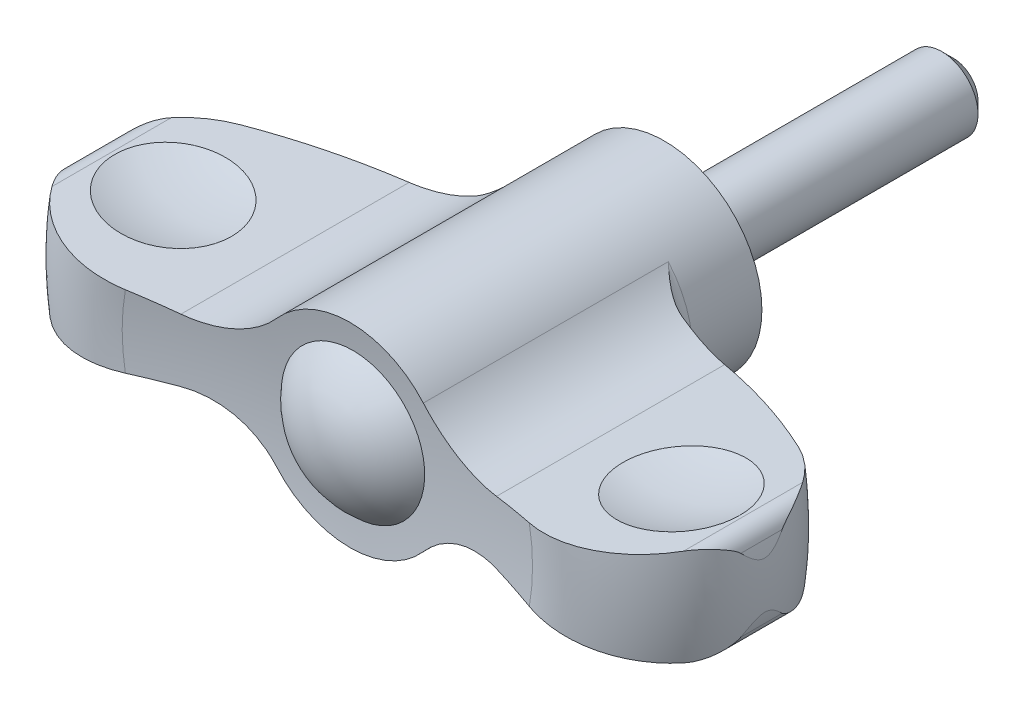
ISO-10303-21;
HEADER;
FILE_DESCRIPTION(('STEP AP214'),'2;1');
FILE_NAME('part.step','',(''),(''),'','','');
FILE_SCHEMA(('AUTOMOTIVE_DESIGN { 1 0 10303 214 1 1 1 1 }'));
ENDSEC;
DATA;
#1=APPLICATION_CONTEXT('core data for automotive mechanical design processes');
#2=APPLICATION_PROTOCOL_DEFINITION('international standard','automotive_design',2000,#1);
#3=PRODUCT_CONTEXT('',#1,'mechanical');
#4=PRODUCT('Part','Part','',(#3));
#5=PRODUCT_RELATED_PRODUCT_CATEGORY('part','',(#4));
#6=PRODUCT_DEFINITION_FORMATION('','',#4);
#7=PRODUCT_DEFINITION_CONTEXT('part definition',#1,'design');
#8=PRODUCT_DEFINITION('design','',#6,#7);
#9=PRODUCT_DEFINITION_SHAPE('','',#8);
#10=(LENGTH_UNIT() NAMED_UNIT(*) SI_UNIT(.MILLI.,.METRE.));
#11=(NAMED_UNIT(*) PLANE_ANGLE_UNIT() SI_UNIT($,.RADIAN.));
#12=(NAMED_UNIT(*) SI_UNIT($,.STERADIAN.) SOLID_ANGLE_UNIT());
#13=UNCERTAINTY_MEASURE_WITH_UNIT(LENGTH_MEASURE(1.E-05),#10,'distance_accuracy_value','');
#14=(GEOMETRIC_REPRESENTATION_CONTEXT(3) GLOBAL_UNCERTAINTY_ASSIGNED_CONTEXT((#13)) GLOBAL_UNIT_ASSIGNED_CONTEXT((#10,
#11,#12)) REPRESENTATION_CONTEXT('',''));
#15=CARTESIAN_POINT('',(0.,0.,0.));
#16=DIRECTION('',(0.,0.,1.));
#17=DIRECTION('',(1.,0.,0.));
#18=AXIS2_PLACEMENT_3D('',#15,#16,#17);
#19=CARTESIAN_POINT('',(0.,0.,72.3));
#20=DIRECTION('',(0.,0.,-1.));
#21=DIRECTION('',(1.,0.,0.));
#22=AXIS2_PLACEMENT_3D('',#19,#20,#21);
#23=SPHERICAL_SURFACE('',#22,51.);
#24=CARTESIAN_POINT('',(0.106101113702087,-0.984705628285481,72.3));
#25=DIRECTION('',(-0.107128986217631,0.994245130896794,0.));
#26=DIRECTION('',(-0.994245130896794,-0.107128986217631,0.));
#27=AXIS2_PLACEMENT_3D('',#24,#25,#26);
#28=CIRCLE('',#27,50.9903824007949);
#29=CARTESIAN_POINT('',(-13.9736878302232,-2.50178976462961,23.3155422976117));
#30=VERTEX_POINT('',#29);
#31=CARTESIAN_POINT('',(-10.91666942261,-2.17239888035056,22.529456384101));
#32=VERTEX_POINT('',#31);
#33=EDGE_CURVE('E30',#30,#32,#28,.F.);
#34=ORIENTED_EDGE('',*,*,#33,.T.);
#35=CARTESIAN_POINT('',(-10.91686942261,-2.17242043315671,22.5295011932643));
#36=CARTESIAN_POINT('',(-10.7296469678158,-2.15222267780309,22.4875506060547));
#37=CARTESIAN_POINT('',(-10.5413017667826,-2.13980901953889,22.4468208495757));
#38=CARTESIAN_POINT('',(-10.1636425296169,-2.13069190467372,22.3680695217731));
#39=CARTESIAN_POINT('',(-9.97432836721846,-2.13399055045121,22.3300483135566));
#40=CARTESIAN_POINT('',(-9.59601268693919,-2.15644826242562,22.2569830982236));
#41=CARTESIAN_POINT('',(-9.40701125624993,-2.17561118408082,22.2219398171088));
#42=CARTESIAN_POINT('',(-9.03072706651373,-2.22980411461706,22.1550981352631));
#43=CARTESIAN_POINT('',(-8.84344419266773,-2.26483305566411,22.1232995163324));
#44=CARTESIAN_POINT('',(-8.47162022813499,-2.35072423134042,22.063129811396));
#45=CARTESIAN_POINT('',(-8.2870846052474,-2.40161451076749,22.034764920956));
#46=CARTESIAN_POINT('',(-7.92248584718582,-2.51896555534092,21.9817487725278));
#47=CARTESIAN_POINT('',(-7.7424225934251,-2.5854259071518,21.9570974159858));
#48=CARTESIAN_POINT('',(-7.38832723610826,-2.7334638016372,21.9117265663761));
#49=CARTESIAN_POINT('',(-7.21428915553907,-2.81502582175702,21.8910030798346));
#50=CARTESIAN_POINT('',(-6.87341920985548,-2.99279306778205,21.8536266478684));
#51=CARTESIAN_POINT('',(-6.70658636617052,-3.08899629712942,21.836973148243));
#52=CARTESIAN_POINT('',(-6.40782206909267,-3.27863643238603,21.8102333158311));
#53=CARTESIAN_POINT('',(-6.27461901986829,-3.36999069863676,21.7995199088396));
#54=CARTESIAN_POINT('',(-6.01493123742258,-3.56204909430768,21.7811068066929));
#55=CARTESIAN_POINT('',(-5.88844563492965,-3.66275200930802,21.7734067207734));
#56=CARTESIAN_POINT('',(-5.64271699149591,-3.87314316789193,21.7610572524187));
#57=CARTESIAN_POINT('',(-5.52348434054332,-3.98284379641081,21.7564121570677));
#58=CARTESIAN_POINT('',(-5.29308424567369,-4.2105332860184,21.7502131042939));
#59=CARTESIAN_POINT('',(-5.18191832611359,-4.32852370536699,21.7486597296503));
#60=CARTESIAN_POINT('',(-5.07512339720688,-4.4503508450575,21.7486647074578));
#61=B_SPLINE_CURVE_WITH_KNOTS('',3,(#35,#36,#37,#38,#39,#40,#41,#42,#43,#44,#45,#46,#47,#48,#49,
#50,#51,#52,#53,#54,#55,#56,#57,#58,#59,#60),.UNSPECIFIED.,.F.,.F.,(4,2,2,2,2,2,2,2,2,2,2,2,4),
(0.,0.578626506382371,1.15733043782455,1.73617505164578,2.31498071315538,2.89481563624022,
3.47463516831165,4.05386199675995,4.63300990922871,5.1182130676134,5.60335328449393,
6.08917285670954,6.57508399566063),.UNSPECIFIED.);
#62=CARTESIAN_POINT('',(-5.07529875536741,-4.4501508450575,21.7486647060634));
#63=VERTEX_POINT('',#62);
#64=EDGE_CURVE('E34',#32,#63,#61,.T.);
#65=ORIENTED_EDGE('',*,*,#64,.T.);
#66=CARTESIAN_POINT('',(0.,0.,21.7486647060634));
#67=DIRECTION('',(0.,0.,1.));
#68=DIRECTION('',(1.,0.,0.));
#69=AXIS2_PLACEMENT_3D('',#66,#67,#68);
#70=CIRCLE('',#69,6.75);
#71=CARTESIAN_POINT('',(5.07529875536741,-4.4501508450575,21.7486647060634));
#72=VERTEX_POINT('',#71);
#73=EDGE_CURVE('E350',#63,#72,#70,.T.);
#74=ORIENTED_EDGE('',*,*,#73,.T.);
#75=CARTESIAN_POINT('',(5.07512339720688,-4.4503508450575,21.7486647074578));
#76=CARTESIAN_POINT('',(5.19811151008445,-4.31003841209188,21.7486568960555));
#77=CARTESIAN_POINT('',(5.32690563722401,-4.1748233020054,21.750718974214));
#78=CARTESIAN_POINT('',(5.59507822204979,-3.91549700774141,21.7589403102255));
#79=CARTESIAN_POINT('',(5.73445549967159,-3.79138458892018,21.7650991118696));
#80=CARTESIAN_POINT('',(6.0224023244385,-3.55546265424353,21.7814490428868));
#81=CARTESIAN_POINT('',(6.17094583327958,-3.44362058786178,21.7916291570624));
#82=CARTESIAN_POINT('',(6.47646460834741,-3.23260452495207,21.8159402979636));
#83=CARTESIAN_POINT('',(6.63343982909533,-3.13343046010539,21.8300713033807));
#84=CARTESIAN_POINT('',(6.9547027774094,-2.94837494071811,21.8621786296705));
#85=CARTESIAN_POINT('',(7.11899194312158,-2.86249611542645,21.8801557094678));
#86=CARTESIAN_POINT('',(7.45373433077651,-2.70454154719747,21.9198257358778));
#87=CARTESIAN_POINT('',(7.62419031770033,-2.63247208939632,21.9415203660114));
#88=CARTESIAN_POINT('',(7.9700647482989,-2.50255377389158,21.9884706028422));
#89=CARTESIAN_POINT('',(8.14548582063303,-2.44471261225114,22.013728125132));
#90=CARTESIAN_POINT('',(8.49988931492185,-2.34360925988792,22.0675996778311));
#91=CARTESIAN_POINT('',(8.67887012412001,-2.30034061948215,22.0962122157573));
#92=CARTESIAN_POINT('',(9.02900148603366,-2.2305564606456,22.1548846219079));
#93=CARTESIAN_POINT('',(9.20002034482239,-2.20322989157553,22.1847703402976));
#94=CARTESIAN_POINT('',(9.54316942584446,-2.1617212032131,22.2471706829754));
#95=CARTESIAN_POINT('',(9.7152996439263,-2.14753903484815,22.2796852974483));
#96=CARTESIAN_POINT('',(10.0596012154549,-2.13229985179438,22.3471369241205));
#97=CARTESIAN_POINT('',(10.2317725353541,-2.13123840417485,22.382073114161));
#98=CARTESIAN_POINT('',(10.5752280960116,-2.14211213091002,22.4541699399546));
#99=CARTESIAN_POINT('',(10.746512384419,-2.154046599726,22.4913304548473));
#100=CARTESIAN_POINT('',(10.91686942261,-2.17242043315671,22.5295011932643));
#101=B_SPLINE_CURVE_WITH_KNOTS('',3,(#75,#76,#77,#78,#79,#80,#81,#82,#83,#84,#85,#86,#87,#88,
#89,#90,#91,#92,#93,#94,#95,#96,#97,#98,#99,#100),.UNSPECIFIED.,.F.,.F.,(4,2,2,2,2,2,2,2,2,2,2,
2,4),(0.,0.559574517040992,1.11908673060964,1.67707683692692,2.2350639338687,2.79316123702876,
3.35151194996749,3.91016401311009,4.46856849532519,4.99529953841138,5.52202861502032,
6.04857972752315,6.57510225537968),.UNSPECIFIED.);
#102=CARTESIAN_POINT('',(10.91666942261,-2.17239888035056,22.529456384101));
#103=VERTEX_POINT('',#102);
#104=EDGE_CURVE('E343',#72,#103,#101,.T.);
#105=ORIENTED_EDGE('',*,*,#104,.T.);
#106=CARTESIAN_POINT('',(-0.10610111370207,-0.984705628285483,72.3));
#107=DIRECTION('',(0.107128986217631,0.994245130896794,0.));
#108=DIRECTION('',(-0.994245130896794,0.107128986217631,0.));
#109=AXIS2_PLACEMENT_3D('',#106,#107,#108);
#110=CIRCLE('',#109,50.9903824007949);
#111=CARTESIAN_POINT('',(13.9736878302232,-2.50178976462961,23.3155422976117));
#112=VERTEX_POINT('',#111);
#113=EDGE_CURVE('E351',#103,#112,#110,.F.);
#114=ORIENTED_EDGE('',*,*,#113,.T.);
#115=CARTESIAN_POINT('',(0.,0.,23.3155422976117));
#116=DIRECTION('',(0.,0.,-1.));
#117=DIRECTION('',(-1.,0.,0.));
#118=AXIS2_PLACEMENT_3D('',#115,#116,#117);
#119=CIRCLE('',#118,14.1958762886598);
#120=CARTESIAN_POINT('',(13.9736878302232,2.50178976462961,23.3155422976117));
#121=VERTEX_POINT('',#120);
#122=EDGE_CURVE('E186',#121,#112,#119,.T.);
#123=ORIENTED_EDGE('',*,*,#122,.F.);
#124=CARTESIAN_POINT('',(-0.10610111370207,0.984705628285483,72.3));
#125=DIRECTION('',(0.107128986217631,-0.994245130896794,0.));
#126=DIRECTION('',(0.994245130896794,0.107128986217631,0.));
#127=AXIS2_PLACEMENT_3D('',#124,#125,#126);
#128=CIRCLE('',#127,50.9903824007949);
#129=CARTESIAN_POINT('',(10.91666942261,2.17239888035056,22.529456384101));
#130=VERTEX_POINT('',#129);
#131=EDGE_CURVE('E370',#121,#130,#128,.F.);
#132=ORIENTED_EDGE('',*,*,#131,.T.);
#133=CARTESIAN_POINT('',(10.91686942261,2.17242043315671,22.5295011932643));
#134=CARTESIAN_POINT('',(10.7296469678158,2.15222267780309,22.4875506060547));
#135=CARTESIAN_POINT('',(10.5413017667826,2.13980901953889,22.4468208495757));
#136=CARTESIAN_POINT('',(10.1636425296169,2.13069190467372,22.3680695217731));
#137=CARTESIAN_POINT('',(9.97432836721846,2.13399055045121,22.3300483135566));
#138=CARTESIAN_POINT('',(9.59601268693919,2.15644826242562,22.2569830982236));
#139=CARTESIAN_POINT('',(9.40701125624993,2.17561118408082,22.2219398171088));
#140=CARTESIAN_POINT('',(9.03072706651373,2.22980411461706,22.1550981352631));
#141=CARTESIAN_POINT('',(8.84344419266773,2.26483305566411,22.1232995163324));
#142=CARTESIAN_POINT('',(8.47162022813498,2.35072423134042,22.063129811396));
#143=CARTESIAN_POINT('',(8.2870846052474,2.40161451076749,22.034764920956));
#144=CARTESIAN_POINT('',(7.92248584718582,2.51896555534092,21.9817487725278));
#145=CARTESIAN_POINT('',(7.7424225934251,2.5854259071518,21.9570974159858));
#146=CARTESIAN_POINT('',(7.38832723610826,2.7334638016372,21.9117265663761));
#147=CARTESIAN_POINT('',(7.21428915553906,2.81502582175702,21.8910030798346));
#148=CARTESIAN_POINT('',(6.87341920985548,2.99279306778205,21.8536266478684));
#149=CARTESIAN_POINT('',(6.70658636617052,3.08899629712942,21.836973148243));
#150=CARTESIAN_POINT('',(6.40782206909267,3.27863643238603,21.8102333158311));
#151=CARTESIAN_POINT('',(6.27461901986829,3.36999069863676,21.7995199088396));
#152=CARTESIAN_POINT('',(6.01493123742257,3.56204909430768,21.7811068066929));
#153=CARTESIAN_POINT('',(5.88844563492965,3.66275200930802,21.7734067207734));
#154=CARTESIAN_POINT('',(5.64271699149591,3.87314316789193,21.7610572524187));
#155=CARTESIAN_POINT('',(5.52348434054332,3.98284379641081,21.7564121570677));
#156=CARTESIAN_POINT('',(5.29308424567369,4.2105332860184,21.7502131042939));
#157=CARTESIAN_POINT('',(5.18191832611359,4.32852370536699,21.7486597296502));
#158=CARTESIAN_POINT('',(5.07512339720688,4.4503508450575,21.7486647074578));
#159=B_SPLINE_CURVE_WITH_KNOTS('',3,(#133,#134,#135,#136,#137,#138,#139,#140,#141,#142,#143,
#144,#145,#146,#147,#148,#149,#150,#151,#152,#153,#154,#155,#156,#157,#158),.UNSPECIFIED.,.F.,
.F.,(4,2,2,2,2,2,2,2,2,2,2,2,4),(0.,0.578626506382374,1.15733043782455,1.73617505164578,
2.31498071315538,2.89481563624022,3.47463516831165,4.05386199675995,4.63300990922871,
5.1182130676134,5.60335328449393,6.08917285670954,6.57508399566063),.UNSPECIFIED.);
#160=CARTESIAN_POINT('',(5.07529875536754,4.45015084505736,21.7486647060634));
#161=VERTEX_POINT('',#160);
#162=EDGE_CURVE('E320',#130,#161,#159,.T.);
#163=ORIENTED_EDGE('',*,*,#162,.T.);
#164=CARTESIAN_POINT('',(0.,0.,21.7486647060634));
#165=DIRECTION('',(0.,0.,1.));
#166=DIRECTION('',(1.,0.,0.));
#167=AXIS2_PLACEMENT_3D('',#164,#165,#166);
#168=CIRCLE('',#167,6.75);
#169=CARTESIAN_POINT('',(-5.07529875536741,4.4501508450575,21.7486647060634));
#170=VERTEX_POINT('',#169);
#171=EDGE_CURVE('E326',#161,#170,#168,.T.);
#172=ORIENTED_EDGE('',*,*,#171,.T.);
#173=CARTESIAN_POINT('',(-5.07512339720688,4.4503508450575,21.7486647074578));
#174=CARTESIAN_POINT('',(-5.19811151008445,4.31003841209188,21.7486568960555));
#175=CARTESIAN_POINT('',(-5.32690563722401,4.1748233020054,21.750718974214));
#176=CARTESIAN_POINT('',(-5.59507822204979,3.91549700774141,21.7589403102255));
#177=CARTESIAN_POINT('',(-5.73445549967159,3.79138458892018,21.7650991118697));
#178=CARTESIAN_POINT('',(-6.0224023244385,3.55546265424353,21.7814490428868));
#179=CARTESIAN_POINT('',(-6.17094583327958,3.44362058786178,21.7916291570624));
#180=CARTESIAN_POINT('',(-6.47646460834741,3.23260452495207,21.8159402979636));
#181=CARTESIAN_POINT('',(-6.63343982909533,3.13343046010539,21.8300713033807));
#182=CARTESIAN_POINT('',(-6.9547027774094,2.94837494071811,21.8621786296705));
#183=CARTESIAN_POINT('',(-7.11899194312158,2.86249611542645,21.8801557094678));
#184=CARTESIAN_POINT('',(-7.45373433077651,2.70454154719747,21.9198257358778));
#185=CARTESIAN_POINT('',(-7.62419031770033,2.63247208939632,21.9415203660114));
#186=CARTESIAN_POINT('',(-7.9700647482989,2.50255377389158,21.9884706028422));
#187=CARTESIAN_POINT('',(-8.14548582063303,2.44471261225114,22.013728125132));
#188=CARTESIAN_POINT('',(-8.49988931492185,2.34360925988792,22.0675996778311));
#189=CARTESIAN_POINT('',(-8.67887012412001,2.30034061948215,22.0962122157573));
#190=CARTESIAN_POINT('',(-9.02900148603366,2.2305564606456,22.1548846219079));
#191=CARTESIAN_POINT('',(-9.20002034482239,2.20322989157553,22.1847703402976));
#192=CARTESIAN_POINT('',(-9.54316942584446,2.1617212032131,22.2471706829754));
#193=CARTESIAN_POINT('',(-9.7152996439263,2.14753903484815,22.2796852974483));
#194=CARTESIAN_POINT('',(-10.0596012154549,2.13229985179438,22.3471369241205));
#195=CARTESIAN_POINT('',(-10.2317725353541,2.13123840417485,22.382073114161));
#196=CARTESIAN_POINT('',(-10.5752280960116,2.14211213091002,22.4541699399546));
#197=CARTESIAN_POINT('',(-10.746512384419,2.154046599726,22.4913304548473));
#198=CARTESIAN_POINT('',(-10.91686942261,2.17242043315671,22.5295011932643));
#199=B_SPLINE_CURVE_WITH_KNOTS('',3,(#173,#174,#175,#176,#177,#178,#179,#180,#181,#182,#183,
#184,#185,#186,#187,#188,#189,#190,#191,#192,#193,#194,#195,#196,#197,#198),.UNSPECIFIED.,.F.,
.F.,(4,2,2,2,2,2,2,2,2,2,2,2,4),(0.,0.559574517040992,1.11908673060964,1.67707683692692,
2.2350639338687,2.79316123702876,3.35151194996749,3.91016401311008,4.46856849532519,
4.99529953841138,5.52202861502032,6.04857972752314,6.57510225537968),.UNSPECIFIED.);
#200=CARTESIAN_POINT('',(-10.91666942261,2.17239888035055,22.529456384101));
#201=VERTEX_POINT('',#200);
#202=EDGE_CURVE('E191',#170,#201,#199,.T.);
#203=ORIENTED_EDGE('',*,*,#202,.T.);
#204=CARTESIAN_POINT('',(0.106101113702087,0.984705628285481,72.3));
#205=DIRECTION('',(-0.107128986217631,-0.994245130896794,0.));
#206=DIRECTION('',(0.994245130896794,-0.107128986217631,0.));
#207=AXIS2_PLACEMENT_3D('',#204,#205,#206);
#208=CIRCLE('',#207,50.9903824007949);
#209=CARTESIAN_POINT('',(-13.9736878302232,2.50178976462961,23.3155422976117));
#210=VERTEX_POINT('',#209);
#211=EDGE_CURVE('E446',#201,#210,#208,.F.);
#212=ORIENTED_EDGE('',*,*,#211,.T.);
#213=EDGE_CURVE('E495',#30,#210,#119,.T.);
#214=ORIENTED_EDGE('',*,*,#213,.F.);
#215=EDGE_LOOP('',(#34,#65,#74,#105,#114,#123,#132,#163,#172,#203,#212,#214));
#216=FACE_BOUND('',#215,.T.);
#217=CARTESIAN_POINT('',(0.,0.,21.5419708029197));
#218=DIRECTION('',(0.,0.,-1.));
#219=DIRECTION('',(-1.,0.,0.));
#220=AXIS2_PLACEMENT_3D('',#217,#218,#219);
#221=CIRCLE('',#220,4.96210358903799);
#222=CARTESIAN_POINT('',(-4.96210358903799,0.,21.5419708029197));
#223=VERTEX_POINT('',#222);
#224=EDGE_CURVE('E383',#223,#223,#221,.T.);
#225=ORIENTED_EDGE('',*,*,#224,.T.);
#226=EDGE_LOOP('',(#225));
#227=FACE_BOUND('',#226,.T.);
#228=ADVANCED_FACE('F14',(#216,#227),#23,.F.);
#229=CARTESIAN_POINT('',(-10.91666942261,-2.17239888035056,24.));
#230=DIRECTION('',(-0.107128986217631,0.994245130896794,0.));
#231=DIRECTION('',(-0.994245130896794,-0.107128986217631,0.));
#232=AXIS2_PLACEMENT_3D('',#229,#230,#231);
#233=PLANE('',#232);
#234=ORIENTED_EDGE('',*,*,#33,.F.);
#235=CARTESIAN_POINT('',(-21.8457309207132,-3.34999507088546,20.5252646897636));
#236=CARTESIAN_POINT('',(-21.7302435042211,-3.33755140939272,20.6912978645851));
#237=CARTESIAN_POINT('',(-21.6077536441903,-3.32435324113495,20.8523984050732));
#238=CARTESIAN_POINT('',(-21.3497248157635,-3.29655087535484,21.1636425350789));
#239=CARTESIAN_POINT('',(-21.2141865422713,-3.28194675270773,21.3137867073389));
#240=CARTESIAN_POINT('',(-20.9311105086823,-3.25144557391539,21.6019360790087));
#241=CARTESIAN_POINT('',(-20.783581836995,-3.23554949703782,21.7399503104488));
#242=CARTESIAN_POINT('',(-20.4774952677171,-3.20256895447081,22.0029918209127));
#243=CARTESIAN_POINT('',(-20.3189374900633,-3.18548450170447,22.1280192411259));
#244=CARTESIAN_POINT('',(-19.9918782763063,-3.15024417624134,22.3642331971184));
#245=CARTESIAN_POINT('',(-19.8233743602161,-3.13208803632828,22.4754162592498));
#246=CARTESIAN_POINT('',(-19.4775952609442,-3.09483066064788,22.6831586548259));
#247=CARTESIAN_POINT('',(-19.3003168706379,-3.07572907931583,22.7797125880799));
#248=CARTESIAN_POINT('',(-18.9383738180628,-3.0367300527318,22.9574348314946));
#249=CARTESIAN_POINT('',(-18.7537118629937,-3.01683289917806,23.0386087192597));
#250=CARTESIAN_POINT('',(-18.3782492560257,-2.97637715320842,23.1850463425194));
#251=CARTESIAN_POINT('',(-18.1874484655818,-2.95581854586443,23.2503097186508));
#252=CARTESIAN_POINT('',(-17.8008818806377,-2.91416635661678,23.3645224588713));
#253=CARTESIAN_POINT('',(-17.6051115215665,-2.89307228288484,23.4134561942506));
#254=CARTESIAN_POINT('',(-17.2101714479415,-2.85051785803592,23.4945837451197));
#255=CARTESIAN_POINT('',(-17.011001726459,-2.82905750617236,23.5267775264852));
#256=CARTESIAN_POINT('',(-16.6106619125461,-2.78592126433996,23.5742057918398));
#257=CARTESIAN_POINT('',(-16.4094916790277,-2.76424535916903,23.589439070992));
#258=CARTESIAN_POINT('',(-16.006594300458,-2.72083354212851,23.6028415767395));
#259=CARTESIAN_POINT('',(-15.804867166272,-2.69909763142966,23.6010111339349));
#260=CARTESIAN_POINT('',(-15.4019677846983,-2.65568559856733,23.5802910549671));
#261=CARTESIAN_POINT('',(-15.2007968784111,-2.63400962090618,23.5613750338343));
#262=CARTESIAN_POINT('',(-14.8008192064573,-2.59091239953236,23.5065973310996));
#263=CARTESIAN_POINT('',(-14.6020116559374,-2.56949107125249,23.47074144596));
#264=CARTESIAN_POINT('',(-14.2079744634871,-2.52703393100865,23.3823184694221));
#265=CARTESIAN_POINT('',(-14.0127471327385,-2.50599836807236,23.3297409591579));
#266=CARTESIAN_POINT('',(-13.6273876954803,-2.46447624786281,23.208260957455));
#267=CARTESIAN_POINT('',(-13.4372553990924,-2.44398967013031,23.1393590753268));
#268=CARTESIAN_POINT('',(-13.0629639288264,-2.40366011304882,22.985531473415));
#269=CARTESIAN_POINT('',(-12.8788206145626,-2.38381884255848,22.9005667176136));
#270=CARTESIAN_POINT('',(-12.5183119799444,-2.34497437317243,22.7153302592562));
#271=CARTESIAN_POINT('',(-12.3419464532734,-2.3259711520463,22.6150589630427));
#272=CARTESIAN_POINT('',(-11.9985630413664,-2.28897190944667,22.400122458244));
#273=CARTESIAN_POINT('',(-11.8315288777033,-2.27097413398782,22.2854835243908));
#274=CARTESIAN_POINT('',(-11.5077189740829,-2.23608391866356,22.0425218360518));
#275=CARTESIAN_POINT('',(-11.3509370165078,-2.21919080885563,21.9142075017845));
#276=CARTESIAN_POINT('',(-11.1514082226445,-2.19769176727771,21.7363546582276));
#277=CARTESIAN_POINT('',(-11.1035524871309,-2.19253535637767,21.6925222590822));
#278=CARTESIAN_POINT('',(-11.0090859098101,-2.18235667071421,21.6036210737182));
#279=CARTESIAN_POINT('',(-10.9624737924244,-2.17733425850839,21.5585536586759));
#280=CARTESIAN_POINT('',(-10.91646942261,-2.17237733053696,21.5128574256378));
#281=B_SPLINE_CURVE_WITH_KNOTS('',3,(#235,#236,#237,#238,#239,#240,#241,#242,#243,#244,#245,
#246,#247,#248,#249,#250,#251,#252,#253,#254,#255,#256,#257,#258,#259,#260,#261,#262,#263,#264,
#265,#266,#267,#268,#269,#270,#271,#272,#273,#274,#275,#276,#277,#278,#279,#280),.UNSPECIFIED.,
.F.,.F.,(4,2,2,2,2,2,2,2,2,2,2,2,2,2,2,2,2,2,2,2,2,2,4),(0.,0.607705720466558,1.21537909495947,
1.82259608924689,2.42980648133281,3.03716892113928,3.64475501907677,4.25212035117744,
4.85949940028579,5.46745810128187,6.07541804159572,6.68342116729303,7.29141251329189,
7.90034437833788,8.50906803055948,9.11817171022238,9.72725265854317,10.3378332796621,
10.9483976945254,11.557861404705,12.166952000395,12.3622359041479,12.5573111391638),.UNSPECIFIED.);
#282=CARTESIAN_POINT('',(-21.8455309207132,-3.34997352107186,20.5255521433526));
#283=VERTEX_POINT('',#282);
#284=EDGE_CURVE('E904',#283,#30,#281,.T.);
#285=ORIENTED_EDGE('',*,*,#284,.F.);
#286=DIRECTION('',(0.,0.,-1.));
#287=VECTOR('',#286,1.);
#288=CARTESIAN_POINT('',(-21.8455309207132,-3.34997352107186,24.));
#289=LINE('',#288,#287);
#290=CARTESIAN_POINT('',(-21.8455309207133,-3.34997352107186,12.2746267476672));
#291=VERTEX_POINT('',#290);
#292=EDGE_CURVE('E465',#283,#291,#289,.T.);
#293=ORIENTED_EDGE('',*,*,#292,.T.);
#294=CARTESIAN_POINT('',(-19.2945778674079,-3.07511070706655,10.0206583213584));
#295=CARTESIAN_POINT('',(-19.4747975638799,-3.09452921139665,10.1153575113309));
#296=CARTESIAN_POINT('',(-19.6509896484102,-3.11351374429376,10.2178086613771));
#297=CARTESIAN_POINT('',(-19.9941575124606,-3.15048976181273,10.4374340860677));
#298=CARTESIAN_POINT('',(-20.1611295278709,-3.16848084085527,10.55461431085));
#299=CARTESIAN_POINT('',(-20.4813600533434,-3.20298538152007,10.8003921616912));
#300=CARTESIAN_POINT('',(-20.6348240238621,-3.21952098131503,10.9287191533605));
#301=CARTESIAN_POINT('',(-20.9305024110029,-3.25138005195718,11.1977390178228));
#302=CARTESIAN_POINT('',(-21.0727226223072,-3.26670414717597,11.3384254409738));
#303=CARTESIAN_POINT('',(-21.3235946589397,-3.29373537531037,11.608219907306));
#304=CARTESIAN_POINT('',(-21.43401009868,-3.3056325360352,11.7356749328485));
#305=CARTESIAN_POINT('',(-21.6465578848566,-3.32853436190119,11.9991858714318));
#306=CARTESIAN_POINT('',(-21.7486121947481,-3.33953061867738,12.135305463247));
#307=CARTESIAN_POINT('',(-21.8457309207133,-3.34999507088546,12.2749142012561));
#308=B_SPLINE_CURVE_WITH_KNOTS('',3,(#294,#295,#296,#297,#298,#299,#300,#301,#302,#303,#304,
#305,#306,#307),.UNSPECIFIED.,.F.,.F.,(4,2,2,2,2,2,4),(0.,0.613344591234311,1.22693775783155,
1.82843414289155,2.42961848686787,2.93636077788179,3.44739305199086),.UNSPECIFIED.);
#309=CARTESIAN_POINT('',(-19.2949583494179,-3.07515170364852,10.0208583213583));
#310=VERTEX_POINT('',#309);
#311=EDGE_CURVE('E877',#310,#291,#308,.T.);
#312=ORIENTED_EDGE('',*,*,#311,.F.);
#313=CARTESIAN_POINT('',(-10.91646942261,-2.17237733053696,6.74022888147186));
#314=CARTESIAN_POINT('',(-11.6429801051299,-2.2506581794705,6.93529272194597));
#315=CARTESIAN_POINT('',(-12.3641189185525,-2.32836021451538,7.15058575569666));
#316=CARTESIAN_POINT('',(-13.791310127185,-2.48213873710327,7.62017172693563));
#317=CARTESIAN_POINT('',(-14.4974016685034,-2.558219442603,7.87434431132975));
#318=CARTESIAN_POINT('',(-15.8945921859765,-2.70876541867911,8.42142446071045));
#319=CARTESIAN_POINT('',(-16.5856911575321,-2.78323068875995,8.71433203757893));
#320=CARTESIAN_POINT('',(-17.9528888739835,-2.93054496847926,9.33891493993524));
#321=CARTESIAN_POINT('',(-18.6289355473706,-3.0033883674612,9.67070557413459));
#322=CARTESIAN_POINT('',(-19.2953387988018,-3.07519269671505,10.0210583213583));
#323=B_SPLINE_CURVE_WITH_KNOTS('',3,(#313,#314,#315,#316,#317,#318,#319,#320,#321,#322),
.UNSPECIFIED.,.F.,.F.,(4,2,2,2,4),(0.,2.26861905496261,4.53035255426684,6.79208674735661,
9.06070650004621),.UNSPECIFIED.);
#324=CARTESIAN_POINT('',(-10.91666942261,-2.17239888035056,6.74028258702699));
#325=VERTEX_POINT('',#324);
#326=EDGE_CURVE('E268',#325,#310,#323,.T.);
#327=ORIENTED_EDGE('',*,*,#326,.F.);
#328=DIRECTION('',(0.,0.,-1.));
#329=VECTOR('',#328,1.);
#330=CARTESIAN_POINT('',(-10.91666942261,-2.17239888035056,24.));
#331=LINE('',#330,#329);
#332=EDGE_CURVE('E462',#32,#325,#331,.T.);
#333=ORIENTED_EDGE('',*,*,#332,.F.);
#334=EDGE_LOOP('',(#234,#285,#293,#312,#327,#333));
#335=FACE_BOUND('',#334,.T.);
#336=CARTESIAN_POINT('',(-17.5815922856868,-2.89053810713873,16.4));
#337=DIRECTION('',(-0.107128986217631,0.994245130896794,0.));
#338=DIRECTION('',(-0.994245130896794,-0.107128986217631,0.));
#339=AXIS2_PLACEMENT_3D('',#336,#337,#338);
#340=CIRCLE('',#339,4.06502356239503);
#341=CARTESIAN_POINT('',(-21.6232221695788,-3.3260199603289,16.4));
#342=VERTEX_POINT('',#341);
#343=EDGE_CURVE('E380',#342,#342,#340,.F.);
#344=ORIENTED_EDGE('',*,*,#343,.F.);
#345=EDGE_LOOP('',(#344));
#346=FACE_BOUND('',#345,.T.);
#347=ADVANCED_FACE('F292',(#335,#346),#233,.F.);
#348=CARTESIAN_POINT('',(-10.91666942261,2.17239888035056,24.));
#349=DIRECTION('',(-0.107128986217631,-0.994245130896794,0.));
#350=DIRECTION('',(0.994245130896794,-0.107128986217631,0.));
#351=AXIS2_PLACEMENT_3D('',#348,#349,#350);
#352=PLANE('',#351);
#353=ORIENTED_EDGE('',*,*,#211,.F.);
#354=DIRECTION('',(0.,0.,-1.));
#355=VECTOR('',#354,1.);
#356=CARTESIAN_POINT('',(-10.91666942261,2.17239888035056,24.));
#357=LINE('',#356,#355);
#358=CARTESIAN_POINT('',(-10.91666942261,2.17239888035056,6.74028258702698));
#359=VERTEX_POINT('',#358);
#360=EDGE_CURVE('E193',#201,#359,#357,.T.);
#361=ORIENTED_EDGE('',*,*,#360,.T.);
#362=CARTESIAN_POINT('',(-19.2953387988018,3.07519269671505,10.0210583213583));
#363=CARTESIAN_POINT('',(-18.6289355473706,3.0033883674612,9.67070557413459));
#364=CARTESIAN_POINT('',(-17.9528888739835,2.93054496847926,9.33891493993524));
#365=CARTESIAN_POINT('',(-16.5856911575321,2.78323068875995,8.71433203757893));
#366=CARTESIAN_POINT('',(-15.8945921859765,2.70876541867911,8.42142446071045));
#367=CARTESIAN_POINT('',(-14.4974016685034,2.558219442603,7.87434431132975));
#368=CARTESIAN_POINT('',(-13.791310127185,2.48213873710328,7.62017172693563));
#369=CARTESIAN_POINT('',(-12.3641189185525,2.32836021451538,7.15058575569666));
#370=CARTESIAN_POINT('',(-11.6429801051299,2.2506581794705,6.93529272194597));
#371=CARTESIAN_POINT('',(-10.91646942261,2.17237733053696,6.74022888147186));
#372=B_SPLINE_CURVE_WITH_KNOTS('',3,(#362,#363,#364,#365,#366,#367,#368,#369,#370,#371),
.UNSPECIFIED.,.F.,.F.,(4,2,2,2,4),(0.,2.2686197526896,4.53035394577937,6.7920874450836,
9.06070650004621),.UNSPECIFIED.);
#373=CARTESIAN_POINT('',(-19.2949583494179,3.07515170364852,10.0208583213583));
#374=VERTEX_POINT('',#373);
#375=EDGE_CURVE('E275',#374,#359,#372,.T.);
#376=ORIENTED_EDGE('',*,*,#375,.F.);
#377=CARTESIAN_POINT('',(-16.1316021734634,2.73430302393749,9.20190527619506));
#378=CARTESIAN_POINT('',(-16.3336188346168,2.75607013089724,9.20643915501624));
#379=CARTESIAN_POINT('',(-16.5354410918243,2.777816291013,9.2195877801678));
#380=CARTESIAN_POINT('',(-16.9372607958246,2.82111198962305,9.2629315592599));
#381=CARTESIAN_POINT('',(-17.1372583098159,2.84266153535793,9.29312608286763));
#382=CARTESIAN_POINT('',(-17.53371131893,2.88537897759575,9.37032135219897));
#383=CARTESIAN_POINT('',(-17.7301716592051,2.90654739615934,9.41729692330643));
#384=CARTESIAN_POINT('',(-18.1184556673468,2.94838463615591,9.52772695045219));
#385=CARTESIAN_POINT('',(-18.310279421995,2.9690534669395,9.59118109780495));
#386=CARTESIAN_POINT('',(-18.6875910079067,3.00970843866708,9.73399849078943));
#387=CARTESIAN_POINT('',(-18.8730894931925,3.02969572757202,9.81333326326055));
#388=CARTESIAN_POINT('',(-19.236871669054,3.0688929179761,9.98746420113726));
#389=CARTESIAN_POINT('',(-19.4151520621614,3.08810246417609,10.0822673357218));
#390=CARTESIAN_POINT('',(-19.7631321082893,3.12559698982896,10.2866372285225));
#391=CARTESIAN_POINT('',(-19.9328321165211,3.14388200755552,10.3962033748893));
#392=CARTESIAN_POINT('',(-20.2623750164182,3.17938994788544,10.6292750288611));
#393=CARTESIAN_POINT('',(-20.4222223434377,3.19661334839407,10.7527741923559));
#394=CARTESIAN_POINT('',(-20.7309200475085,3.22987523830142,11.0128081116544));
#395=CARTESIAN_POINT('',(-20.8797763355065,3.24591436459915,11.1493357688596));
#396=CARTESIAN_POINT('',(-21.1655301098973,3.27670406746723,11.4345171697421));
#397=CARTESIAN_POINT('',(-21.3024274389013,3.29145462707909,11.58317107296));
#398=CARTESIAN_POINT('',(-21.5634920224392,3.3195840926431,11.8918051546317));
#399=CARTESIAN_POINT('',(-21.6876381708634,3.33296072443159,12.0518033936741));
#400=CARTESIAN_POINT('',(-21.9220837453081,3.35822201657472,12.3817648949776));
#401=CARTESIAN_POINT('',(-22.0323824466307,3.37010659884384,12.5517286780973));
#402=CARTESIAN_POINT('',(-22.1353199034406,3.3811980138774,12.7260937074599));
#403=B_SPLINE_CURVE_WITH_KNOTS('',3,(#377,#378,#379,#380,#381,#382,#383,#384,#385,#386,#387,
#388,#389,#390,#391,#392,#393,#394,#395,#396,#397,#398,#399,#400,#401,#402),.UNSPECIFIED.,.F.,
.F.,(4,2,2,2,2,2,2,2,2,2,2,2,4),(0.,0.60952472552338,1.21902691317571,1.82761855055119,
2.43619878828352,3.04369749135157,3.65147065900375,4.25921864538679,4.86669101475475,
5.47383427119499,6.080985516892,6.68912606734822,7.29729843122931),.UNSPECIFIED.);
#404=CARTESIAN_POINT('',(-21.845530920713,3.34997352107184,12.2746267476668));
#405=VERTEX_POINT('',#404);
#406=EDGE_CURVE('E302',#405,#374,#403,.F.);
#407=ORIENTED_EDGE('',*,*,#406,.F.);
#408=DIRECTION('',(0.,0.,-1.));
#409=VECTOR('',#408,1.);
#410=CARTESIAN_POINT('',(-21.8455309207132,3.34997352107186,24.));
#411=LINE('',#410,#409);
#412=CARTESIAN_POINT('',(-21.8455309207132,3.34997352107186,20.5255521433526));
#413=VERTEX_POINT('',#412);
#414=EDGE_CURVE('E198',#413,#405,#411,.T.);
#415=ORIENTED_EDGE('',*,*,#414,.F.);
#416=CARTESIAN_POINT('',(-10.91646942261,2.17237733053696,21.5128574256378));
#417=CARTESIAN_POINT('',(-11.060414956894,2.18788732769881,21.6558705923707));
#418=CARTESIAN_POINT('',(-11.2103909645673,2.20404710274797,21.7927365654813));
#419=CARTESIAN_POINT('',(-11.5212615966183,2.23754312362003,22.0532734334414));
#420=CARTESIAN_POINT('',(-11.682155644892,2.25487930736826,22.1769450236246));
#421=CARTESIAN_POINT('',(-12.013622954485,2.29059460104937,22.4101285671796));
#422=CARTESIAN_POINT('',(-12.1841895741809,2.3089729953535,22.5196500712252));
#423=CARTESIAN_POINT('',(-12.5338820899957,2.3466520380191,22.723861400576));
#424=CARTESIAN_POINT('',(-12.7130078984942,2.36595267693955,22.8185513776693));
#425=CARTESIAN_POINT('',(-13.0785959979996,2.40534445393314,22.9924500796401));
#426=CARTESIAN_POINT('',(-13.2650601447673,2.42543579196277,23.0716548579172));
#427=CARTESIAN_POINT('',(-13.6440277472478,2.46626919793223,23.2140153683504));
#428=CARTESIAN_POINT('',(-13.8365334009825,2.48701150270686,23.2771651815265));
#429=CARTESIAN_POINT('',(-14.2260776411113,2.5289845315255,23.3869042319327));
#430=CARTESIAN_POINT('',(-14.4231144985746,2.55021506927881,23.433499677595));
#431=CARTESIAN_POINT('',(-14.8203952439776,2.59302169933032,23.5098273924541));
#432=CARTESIAN_POINT('',(-15.0206391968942,2.6145977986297,23.5395593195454));
#433=CARTESIAN_POINT('',(-15.4229162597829,2.65794277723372,23.581941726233));
#434=CARTESIAN_POINT('',(-15.6249494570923,2.67971166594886,23.5945913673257));
#435=CARTESIAN_POINT('',(-16.0293573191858,2.72328623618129,23.6027094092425));
#436=CARTESIAN_POINT('',(-16.2317319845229,2.74509191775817,23.5981777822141));
#437=CARTESIAN_POINT('',(-16.6353922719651,2.78858593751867,23.5719573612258));
#438=CARTESIAN_POINT('',(-16.8366778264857,2.81027426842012,23.5502675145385));
#439=CARTESIAN_POINT('',(-17.2367059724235,2.85337692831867,23.4898773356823));
#440=CARTESIAN_POINT('',(-17.4354486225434,2.87479126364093,23.451177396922));
#441=CARTESIAN_POINT('',(-17.8286809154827,2.91716167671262,23.3571066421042));
#442=CARTESIAN_POINT('',(-18.0231764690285,2.93811839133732,23.3017608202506));
#443=CARTESIAN_POINT('',(-18.4067663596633,2.97944984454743,23.1747874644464));
#444=CARTESIAN_POINT('',(-18.5958625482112,2.99982478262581,23.1031655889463));
#445=CARTESIAN_POINT('',(-18.9674894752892,3.03986723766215,22.9440840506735));
#446=CARTESIAN_POINT('',(-19.1500160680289,3.05953430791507,22.8566145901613));
#447=CARTESIAN_POINT('',(-19.5070671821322,3.09800623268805,22.6664899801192));
#448=CARTESIAN_POINT('',(-19.6815920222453,3.11681112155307,22.5638354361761));
#449=CARTESIAN_POINT('',(-20.0212685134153,3.15341094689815,22.3441502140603));
#450=CARTESIAN_POINT('',(-20.1864271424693,3.17120663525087,22.2271304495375));
#451=CARTESIAN_POINT('',(-20.5063289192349,3.20567575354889,21.9794851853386));
#452=CARTESIAN_POINT('',(-20.6610723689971,3.22234921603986,21.8488600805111));
#453=CARTESIAN_POINT('',(-20.9587578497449,3.25442454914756,21.5751939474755));
#454=CARTESIAN_POINT('',(-21.1017211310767,3.26982870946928,21.4321762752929));
#455=CARTESIAN_POINT('',(-21.3750859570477,3.29928351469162,21.1345878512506));
#456=CARTESIAN_POINT('',(-21.5054952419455,3.31333499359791,20.9800243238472));
#457=CARTESIAN_POINT('',(-21.6665115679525,3.33068435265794,20.7720063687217));
#458=CARTESIAN_POINT('',(-21.7032508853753,3.3346429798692,20.7232730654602));
#459=CARTESIAN_POINT('',(-21.7754460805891,3.34242194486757,20.6249310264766));
#460=CARTESIAN_POINT('',(-21.8109032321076,3.34624241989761,20.5753232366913));
#461=CARTESIAN_POINT('',(-21.8457309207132,3.34999507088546,20.5252646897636));
#462=B_SPLINE_CURVE_WITH_KNOTS('',3,(#416,#417,#418,#419,#420,#421,#422,#423,#424,#425,#426,
#427,#428,#429,#430,#431,#432,#433,#434,#435,#436,#437,#438,#439,#440,#441,#442,#443,#444,#445,
#446,#447,#448,#449,#450,#451,#452,#453,#454,#455,#456,#457,#458,#459,#460,#461),.UNSPECIFIED.,
.F.,.F.,(4,2,2,2,2,2,2,2,2,2,2,2,2,2,2,2,2,2,2,2,2,2,4),(0.,0.610322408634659,1.22061263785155,
1.83048877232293,2.44035866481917,3.05038378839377,3.66063348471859,4.27065407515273,
4.88068704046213,5.49074994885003,6.10081384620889,6.71091517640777,7.32100239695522,
7.93017809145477,8.5391423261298,9.14848434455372,9.75780206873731,10.3666597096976,
10.9754996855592,11.5832161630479,12.1905555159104,12.3740180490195,12.5572930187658),.UNSPECIFIED.);
#463=EDGE_CURVE('E308',#210,#413,#462,.T.);
#464=ORIENTED_EDGE('',*,*,#463,.F.);
#465=EDGE_LOOP('',(#353,#361,#376,#407,#415,#464));
#466=FACE_BOUND('',#465,.T.);
#467=CARTESIAN_POINT('',(-17.5815922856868,2.89053810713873,16.4));
#468=DIRECTION('',(-0.107128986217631,-0.994245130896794,0.));
#469=DIRECTION('',(0.994245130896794,-0.107128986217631,0.));
#470=AXIS2_PLACEMENT_3D('',#467,#468,#469);
#471=CIRCLE('',#470,4.06502356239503);
#472=CARTESIAN_POINT('',(-13.5399624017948,2.45505625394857,16.4));
#473=VERTEX_POINT('',#472);
#474=EDGE_CURVE('E377',#473,#473,#471,.F.);
#475=ORIENTED_EDGE('',*,*,#474,.F.);
#476=EDGE_LOOP('',(#475));
#477=FACE_BOUND('',#476,.T.);
#478=ADVANCED_FACE('F287',(#466,#477),#352,.F.);
#479=CARTESIAN_POINT('',(10.91666942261,-2.17239888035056,24.));
#480=DIRECTION('',(0.107128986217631,0.994245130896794,0.));
#481=DIRECTION('',(-0.994245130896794,0.107128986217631,0.));
#482=AXIS2_PLACEMENT_3D('',#479,#480,#481);
#483=PLANE('',#482);
#484=ORIENTED_EDGE('',*,*,#113,.F.);
#485=DIRECTION('',(0.,0.,-1.));
#486=VECTOR('',#485,1.);
#487=CARTESIAN_POINT('',(10.91666942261,-2.17239888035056,24.));
#488=LINE('',#487,#486);
#489=CARTESIAN_POINT('',(10.91666942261,-2.17239888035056,6.74028258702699));
#490=VERTEX_POINT('',#489);
#491=EDGE_CURVE('E441',#103,#490,#488,.T.);
#492=ORIENTED_EDGE('',*,*,#491,.T.);
#493=CARTESIAN_POINT('',(19.2953387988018,-3.07519269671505,10.0210583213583));
#494=CARTESIAN_POINT('',(18.6289355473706,-3.0033883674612,9.67070557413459));
#495=CARTESIAN_POINT('',(17.9528888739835,-2.93054496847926,9.33891493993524));
#496=CARTESIAN_POINT('',(16.5856911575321,-2.78323068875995,8.71433203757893));
#497=CARTESIAN_POINT('',(15.8945921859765,-2.70876541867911,8.42142446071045));
#498=CARTESIAN_POINT('',(14.4974016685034,-2.558219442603,7.87434431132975));
#499=CARTESIAN_POINT('',(13.791310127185,-2.48213873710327,7.62017172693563));
#500=CARTESIAN_POINT('',(12.3641189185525,-2.32836021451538,7.15058575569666));
#501=CARTESIAN_POINT('',(11.6429801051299,-2.2506581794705,6.93529272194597));
#502=CARTESIAN_POINT('',(10.91646942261,-2.17237733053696,6.74022888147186));
#503=B_SPLINE_CURVE_WITH_KNOTS('',3,(#493,#494,#495,#496,#497,#498,#499,#500,#501,#502),
.UNSPECIFIED.,.F.,.F.,(4,2,2,2,4),(0.,2.2686197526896,4.53035394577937,6.7920874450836,
9.06070650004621),.UNSPECIFIED.);
#504=CARTESIAN_POINT('',(19.2949583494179,-3.07515170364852,10.0208583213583));
#505=VERTEX_POINT('',#504);
#506=EDGE_CURVE('E245',#505,#490,#503,.T.);
#507=ORIENTED_EDGE('',*,*,#506,.F.);
#508=CARTESIAN_POINT('',(16.1316021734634,-2.73430302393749,9.20190527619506));
#509=CARTESIAN_POINT('',(16.3336188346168,-2.75607013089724,9.20643915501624));
#510=CARTESIAN_POINT('',(16.5354410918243,-2.777816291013,9.2195877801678));
#511=CARTESIAN_POINT('',(16.9372607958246,-2.82111198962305,9.2629315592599));
#512=CARTESIAN_POINT('',(17.1372583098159,-2.84266153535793,9.29312608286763));
#513=CARTESIAN_POINT('',(17.53371131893,-2.88537897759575,9.37032135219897));
#514=CARTESIAN_POINT('',(17.7301716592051,-2.90654739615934,9.41729692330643));
#515=CARTESIAN_POINT('',(18.1184556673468,-2.94838463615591,9.52772695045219));
#516=CARTESIAN_POINT('',(18.310279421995,-2.9690534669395,9.59118109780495));
#517=CARTESIAN_POINT('',(18.6875910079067,-3.00970843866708,9.73399849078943));
#518=CARTESIAN_POINT('',(18.8730894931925,-3.02969572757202,9.81333326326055));
#519=CARTESIAN_POINT('',(19.236871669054,-3.0688929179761,9.98746420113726));
#520=CARTESIAN_POINT('',(19.4151520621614,-3.08810246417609,10.0822673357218));
#521=CARTESIAN_POINT('',(19.7631321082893,-3.12559698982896,10.2866372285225));
#522=CARTESIAN_POINT('',(19.9328321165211,-3.14388200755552,10.3962033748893));
#523=CARTESIAN_POINT('',(20.2623750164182,-3.17938994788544,10.6292750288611));
#524=CARTESIAN_POINT('',(20.4222223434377,-3.19661334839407,10.7527741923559));
#525=CARTESIAN_POINT('',(20.7309200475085,-3.22987523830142,11.0128081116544));
#526=CARTESIAN_POINT('',(20.8797763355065,-3.24591436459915,11.1493357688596));
#527=CARTESIAN_POINT('',(21.1655301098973,-3.27670406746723,11.4345171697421));
#528=CARTESIAN_POINT('',(21.3024274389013,-3.29145462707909,11.58317107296));
#529=CARTESIAN_POINT('',(21.5634920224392,-3.3195840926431,11.8918051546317));
#530=CARTESIAN_POINT('',(21.6876381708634,-3.33296072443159,12.0518033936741));
#531=CARTESIAN_POINT('',(21.9220837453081,-3.35822201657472,12.3817648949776));
#532=CARTESIAN_POINT('',(22.0323824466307,-3.37010659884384,12.5517286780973));
#533=CARTESIAN_POINT('',(22.1353199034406,-3.3811980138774,12.7260937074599));
#534=B_SPLINE_CURVE_WITH_KNOTS('',3,(#508,#509,#510,#511,#512,#513,#514,#515,#516,#517,#518,
#519,#520,#521,#522,#523,#524,#525,#526,#527,#528,#529,#530,#531,#532,#533),.UNSPECIFIED.,.F.,
.F.,(4,2,2,2,2,2,2,2,2,2,2,2,4),(0.,0.60952472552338,1.21902691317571,1.82761855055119,
2.43619878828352,3.04369749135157,3.65147065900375,4.25921864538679,4.86669101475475,
5.47383427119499,6.080985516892,6.68912606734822,7.29729843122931),.UNSPECIFIED.);
#535=CARTESIAN_POINT('',(21.845530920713,-3.34997352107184,12.2746267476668));
#536=VERTEX_POINT('',#535);
#537=EDGE_CURVE('E549',#536,#505,#534,.F.);
#538=ORIENTED_EDGE('',*,*,#537,.F.);
#539=DIRECTION('',(0.,0.,-1.));
#540=VECTOR('',#539,1.);
#541=CARTESIAN_POINT('',(21.8455309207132,-3.34997352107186,24.));
#542=LINE('',#541,#540);
#543=CARTESIAN_POINT('',(21.8455309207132,-3.34997352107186,20.5255521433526));
#544=VERTEX_POINT('',#543);
#545=EDGE_CURVE('E453',#544,#536,#542,.T.);
#546=ORIENTED_EDGE('',*,*,#545,.F.);
#547=CARTESIAN_POINT('',(10.91646942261,-2.17237733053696,21.5128574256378));
#548=CARTESIAN_POINT('',(11.060414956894,-2.18788732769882,21.6558705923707));
#549=CARTESIAN_POINT('',(11.2103909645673,-2.20404710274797,21.7927365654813));
#550=CARTESIAN_POINT('',(11.5212615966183,-2.23754312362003,22.0532734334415));
#551=CARTESIAN_POINT('',(11.682155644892,-2.25487930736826,22.1769450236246));
#552=CARTESIAN_POINT('',(12.0136229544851,-2.29059460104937,22.4101285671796));
#553=CARTESIAN_POINT('',(12.1841895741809,-2.3089729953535,22.5196500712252));
#554=CARTESIAN_POINT('',(12.5338820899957,-2.3466520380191,22.723861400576));
#555=CARTESIAN_POINT('',(12.7130078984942,-2.36595267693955,22.8185513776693));
#556=CARTESIAN_POINT('',(13.0785959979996,-2.40534445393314,22.9924500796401));
#557=CARTESIAN_POINT('',(13.2650601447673,-2.42543579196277,23.0716548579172));
#558=CARTESIAN_POINT('',(13.6440277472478,-2.46626919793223,23.2140153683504));
#559=CARTESIAN_POINT('',(13.8365334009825,-2.48701150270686,23.2771651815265));
#560=CARTESIAN_POINT('',(14.2260776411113,-2.5289845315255,23.3869042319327));
#561=CARTESIAN_POINT('',(14.4231144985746,-2.55021506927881,23.433499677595));
#562=CARTESIAN_POINT('',(14.8203952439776,-2.59302169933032,23.5098273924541));
#563=CARTESIAN_POINT('',(15.0206391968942,-2.6145977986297,23.5395593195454));
#564=CARTESIAN_POINT('',(15.4229162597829,-2.65794277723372,23.581941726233));
#565=CARTESIAN_POINT('',(15.6249494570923,-2.67971166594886,23.5945913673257));
#566=CARTESIAN_POINT('',(16.0293573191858,-2.72328623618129,23.6027094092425));
#567=CARTESIAN_POINT('',(16.2317319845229,-2.74509191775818,23.5981777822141));
#568=CARTESIAN_POINT('',(16.6353922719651,-2.78858593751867,23.5719573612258));
#569=CARTESIAN_POINT('',(16.8366778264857,-2.81027426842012,23.5502675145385));
#570=CARTESIAN_POINT('',(17.2367059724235,-2.85337692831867,23.4898773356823));
#571=CARTESIAN_POINT('',(17.4354486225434,-2.87479126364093,23.451177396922));
#572=CARTESIAN_POINT('',(17.8286809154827,-2.91716167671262,23.3571066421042));
#573=CARTESIAN_POINT('',(18.0231764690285,-2.93811839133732,23.3017608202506));
#574=CARTESIAN_POINT('',(18.4067663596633,-2.97944984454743,23.1747874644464));
#575=CARTESIAN_POINT('',(18.5958625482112,-2.99982478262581,23.1031655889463));
#576=CARTESIAN_POINT('',(18.9674894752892,-3.03986723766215,22.9440840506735));
#577=CARTESIAN_POINT('',(19.1500160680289,-3.05953430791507,22.8566145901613));
#578=CARTESIAN_POINT('',(19.5070671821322,-3.09800623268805,22.6664899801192));
#579=CARTESIAN_POINT('',(19.6815920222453,-3.11681112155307,22.5638354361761));
#580=CARTESIAN_POINT('',(20.0212685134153,-3.15341094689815,22.3441502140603));
#581=CARTESIAN_POINT('',(20.1864271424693,-3.17120663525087,22.2271304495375));
#582=CARTESIAN_POINT('',(20.5063289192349,-3.20567575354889,21.9794851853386));
#583=CARTESIAN_POINT('',(20.6610723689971,-3.22234921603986,21.8488600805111));
#584=CARTESIAN_POINT('',(20.9587578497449,-3.25442454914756,21.5751939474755));
#585=CARTESIAN_POINT('',(21.1017211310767,-3.26982870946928,21.4321762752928));
#586=CARTESIAN_POINT('',(21.3750859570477,-3.29928351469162,21.1345878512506));
#587=CARTESIAN_POINT('',(21.5054952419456,-3.31333499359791,20.9800243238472));
#588=CARTESIAN_POINT('',(21.6665115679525,-3.33068435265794,20.7720063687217));
#589=CARTESIAN_POINT('',(21.7032508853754,-3.3346429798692,20.7232730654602));
#590=CARTESIAN_POINT('',(21.7754460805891,-3.34242194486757,20.6249310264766));
#591=CARTESIAN_POINT('',(21.8109032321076,-3.34624241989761,20.5753232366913));
#592=CARTESIAN_POINT('',(21.8457309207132,-3.34999507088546,20.5252646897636));
#593=B_SPLINE_CURVE_WITH_KNOTS('',3,(#547,#548,#549,#550,#551,#552,#553,#554,#555,#556,#557,
#558,#559,#560,#561,#562,#563,#564,#565,#566,#567,#568,#569,#570,#571,#572,#573,#574,#575,#576,
#577,#578,#579,#580,#581,#582,#583,#584,#585,#586,#587,#588,#589,#590,#591,#592),.UNSPECIFIED.,
.F.,.F.,(4,2,2,2,2,2,2,2,2,2,2,2,2,2,2,2,2,2,2,2,2,2,4),(0.,0.610322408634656,1.22061263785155,
1.83048877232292,2.44035866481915,3.05038378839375,3.66063348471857,4.27065407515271,
4.88068704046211,5.49074994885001,6.10081384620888,6.71091517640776,7.3210023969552,
7.93017809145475,8.53914232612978,9.14848434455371,9.7578020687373,10.3666597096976,
10.9754996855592,11.5832161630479,12.1905555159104,12.3740180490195,12.5572930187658),.UNSPECIFIED.);
#594=EDGE_CURVE('E443',#112,#544,#593,.T.);
#595=ORIENTED_EDGE('',*,*,#594,.F.);
#596=EDGE_LOOP('',(#484,#492,#507,#538,#546,#595));
#597=FACE_BOUND('',#596,.T.);
#598=CARTESIAN_POINT('',(17.5815922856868,-2.89053810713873,16.4));
#599=DIRECTION('',(0.107128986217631,0.994245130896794,0.));
#600=DIRECTION('',(-0.994245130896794,0.107128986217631,0.));
#601=AXIS2_PLACEMENT_3D('',#598,#599,#600);
#602=CIRCLE('',#601,4.06502356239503);
#603=CARTESIAN_POINT('',(13.5399624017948,-2.45505625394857,16.4));
#604=VERTEX_POINT('',#603);
#605=EDGE_CURVE('E374',#604,#604,#602,.F.);
#606=ORIENTED_EDGE('',*,*,#605,.F.);
#607=EDGE_LOOP('',(#606));
#608=FACE_BOUND('',#607,.T.);
#609=ADVANCED_FACE('F291',(#597,#608),#483,.F.);
#610=CARTESIAN_POINT('',(10.91666942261,2.17239888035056,24.));
#611=DIRECTION('',(0.107128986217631,-0.994245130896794,0.));
#612=DIRECTION('',(0.994245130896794,0.107128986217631,0.));
#613=AXIS2_PLACEMENT_3D('',#610,#611,#612);
#614=PLANE('',#613);
#615=ORIENTED_EDGE('',*,*,#131,.F.);
#616=CARTESIAN_POINT('',(21.8457309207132,3.34999507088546,20.5252646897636));
#617=CARTESIAN_POINT('',(21.7302435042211,3.33755140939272,20.6912978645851));
#618=CARTESIAN_POINT('',(21.6077536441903,3.32435324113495,20.8523984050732));
#619=CARTESIAN_POINT('',(21.3497248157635,3.29655087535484,21.1636425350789));
#620=CARTESIAN_POINT('',(21.2141865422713,3.28194675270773,21.3137867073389));
#621=CARTESIAN_POINT('',(20.9311105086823,3.25144557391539,21.6019360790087));
#622=CARTESIAN_POINT('',(20.783581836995,3.23554949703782,21.7399503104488));
#623=CARTESIAN_POINT('',(20.4774952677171,3.20256895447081,22.0029918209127));
#624=CARTESIAN_POINT('',(20.3189374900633,3.18548450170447,22.1280192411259));
#625=CARTESIAN_POINT('',(19.9918782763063,3.15024417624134,22.3642331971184));
#626=CARTESIAN_POINT('',(19.8233743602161,3.13208803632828,22.4754162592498));
#627=CARTESIAN_POINT('',(19.4775952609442,3.09483066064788,22.6831586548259));
#628=CARTESIAN_POINT('',(19.3003168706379,3.07572907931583,22.7797125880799));
#629=CARTESIAN_POINT('',(18.9383738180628,3.0367300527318,22.9574348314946));
#630=CARTESIAN_POINT('',(18.7537118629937,3.01683289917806,23.0386087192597));
#631=CARTESIAN_POINT('',(18.3782492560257,2.97637715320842,23.1850463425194));
#632=CARTESIAN_POINT('',(18.1874484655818,2.95581854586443,23.2503097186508));
#633=CARTESIAN_POINT('',(17.8008818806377,2.91416635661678,23.3645224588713));
#634=CARTESIAN_POINT('',(17.6051115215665,2.89307228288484,23.4134561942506));
#635=CARTESIAN_POINT('',(17.2101714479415,2.85051785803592,23.4945837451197));
#636=CARTESIAN_POINT('',(17.011001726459,2.82905750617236,23.5267775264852));
#637=CARTESIAN_POINT('',(16.6106619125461,2.78592126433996,23.5742057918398));
#638=CARTESIAN_POINT('',(16.4094916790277,2.76424535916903,23.589439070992));
#639=CARTESIAN_POINT('',(16.006594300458,2.72083354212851,23.6028415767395));
#640=CARTESIAN_POINT('',(15.804867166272,2.69909763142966,23.6010111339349));
#641=CARTESIAN_POINT('',(15.4019677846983,2.65568559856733,23.5802910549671));
#642=CARTESIAN_POINT('',(15.2007968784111,2.63400962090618,23.5613750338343));
#643=CARTESIAN_POINT('',(14.8008192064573,2.59091239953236,23.5065973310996));
#644=CARTESIAN_POINT('',(14.6020116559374,2.56949107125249,23.47074144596));
#645=CARTESIAN_POINT('',(14.2079744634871,2.52703393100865,23.3823184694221));
#646=CARTESIAN_POINT('',(14.0127471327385,2.50599836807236,23.3297409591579));
#647=CARTESIAN_POINT('',(13.6273876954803,2.46447624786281,23.208260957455));
#648=CARTESIAN_POINT('',(13.4372553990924,2.44398967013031,23.1393590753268));
#649=CARTESIAN_POINT('',(13.0629639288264,2.40366011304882,22.985531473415));
#650=CARTESIAN_POINT('',(12.8788206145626,2.38381884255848,22.9005667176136));
#651=CARTESIAN_POINT('',(12.5183119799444,2.34497437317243,22.7153302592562));
#652=CARTESIAN_POINT('',(12.3419464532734,2.3259711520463,22.6150589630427));
#653=CARTESIAN_POINT('',(11.9985630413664,2.28897190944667,22.400122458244));
#654=CARTESIAN_POINT('',(11.8315288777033,2.27097413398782,22.2854835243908));
#655=CARTESIAN_POINT('',(11.5077189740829,2.23608391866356,22.0425218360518));
#656=CARTESIAN_POINT('',(11.3509370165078,2.21919080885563,21.9142075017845));
#657=CARTESIAN_POINT('',(11.1514082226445,2.19769176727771,21.7363546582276));
#658=CARTESIAN_POINT('',(11.1035524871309,2.19253535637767,21.6925222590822));
#659=CARTESIAN_POINT('',(11.0090859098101,2.18235667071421,21.6036210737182));
#660=CARTESIAN_POINT('',(10.9624737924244,2.17733425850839,21.5585536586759));
#661=CARTESIAN_POINT('',(10.91646942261,2.17237733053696,21.5128574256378));
#662=B_SPLINE_CURVE_WITH_KNOTS('',3,(#616,#617,#618,#619,#620,#621,#622,#623,#624,#625,#626,
#627,#628,#629,#630,#631,#632,#633,#634,#635,#636,#637,#638,#639,#640,#641,#642,#643,#644,#645,
#646,#647,#648,#649,#650,#651,#652,#653,#654,#655,#656,#657,#658,#659,#660,#661),.UNSPECIFIED.,
.F.,.F.,(4,2,2,2,2,2,2,2,2,2,2,2,2,2,2,2,2,2,2,2,2,2,4),(0.,0.607705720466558,1.21537909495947,
1.82259608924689,2.42980648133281,3.03716892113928,3.64475501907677,4.25212035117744,
4.85949940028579,5.46745810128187,6.07541804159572,6.68342116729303,7.29141251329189,
7.90034437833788,8.50906803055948,9.11817171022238,9.72725265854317,10.3378332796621,
10.9483976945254,11.557861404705,12.166952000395,12.3622359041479,12.5573111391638),.UNSPECIFIED.);
#663=CARTESIAN_POINT('',(21.8455309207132,3.34997352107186,20.5255521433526));
#664=VERTEX_POINT('',#663);
#665=EDGE_CURVE('E504',#664,#121,#662,.T.);
#666=ORIENTED_EDGE('',*,*,#665,.F.);
#667=DIRECTION('',(0.,0.,-1.));
#668=VECTOR('',#667,1.);
#669=CARTESIAN_POINT('',(21.8455309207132,3.34997352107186,24.));
#670=LINE('',#669,#668);
#671=CARTESIAN_POINT('',(21.8455309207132,3.34997352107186,12.2746267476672));
#672=VERTEX_POINT('',#671);
#673=EDGE_CURVE('E528',#664,#672,#670,.T.);
#674=ORIENTED_EDGE('',*,*,#673,.T.);
#675=CARTESIAN_POINT('',(19.2945778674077,3.07511070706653,10.0206583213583));
#676=CARTESIAN_POINT('',(19.4747975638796,3.09452921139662,10.1153575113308));
#677=CARTESIAN_POINT('',(19.65098964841,3.11351374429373,10.2178086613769));
#678=CARTESIAN_POINT('',(19.9941575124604,3.1504897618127,10.4374340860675));
#679=CARTESIAN_POINT('',(20.1611295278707,3.16848084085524,10.5546143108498));
#680=CARTESIAN_POINT('',(20.4813600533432,3.20298538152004,10.800392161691));
#681=CARTESIAN_POINT('',(20.6348240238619,3.219520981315,10.9287191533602));
#682=CARTESIAN_POINT('',(20.9305024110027,3.25138005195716,11.1977390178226));
#683=CARTESIAN_POINT('',(21.072722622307,3.26670414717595,11.3384254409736));
#684=CARTESIAN_POINT('',(21.3235946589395,3.29373537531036,11.6082199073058));
#685=CARTESIAN_POINT('',(21.4340100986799,3.30563253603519,11.7356749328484));
#686=CARTESIAN_POINT('',(21.6465578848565,3.32853436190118,11.9991858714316));
#687=CARTESIAN_POINT('',(21.7486121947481,3.33953061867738,12.1353054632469));
#688=CARTESIAN_POINT('',(21.8457309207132,3.34999507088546,12.2749142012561));
#689=B_SPLINE_CURVE_WITH_KNOTS('',3,(#675,#676,#677,#678,#679,#680,#681,#682,#683,#684,#685,
#686,#687,#688),.UNSPECIFIED.,.F.,.F.,(4,2,2,2,2,2,4),(0.,0.6133445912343,1.22693775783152,
1.82843414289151,2.42961848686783,2.9363607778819,3.44739305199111),.UNSPECIFIED.);
#690=CARTESIAN_POINT('',(19.2949583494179,3.07515170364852,10.0208583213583));
#691=VERTEX_POINT('',#690);
#692=EDGE_CURVE('E209',#691,#672,#689,.T.);
#693=ORIENTED_EDGE('',*,*,#692,.F.);
#694=CARTESIAN_POINT('',(10.91646942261,2.17237733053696,6.74022888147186));
#695=CARTESIAN_POINT('',(11.6429801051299,2.2506581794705,6.93529272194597));
#696=CARTESIAN_POINT('',(12.3641189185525,2.32836021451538,7.15058575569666));
#697=CARTESIAN_POINT('',(13.791310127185,2.48213873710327,7.62017172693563));
#698=CARTESIAN_POINT('',(14.4974016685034,2.558219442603,7.87434431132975));
#699=CARTESIAN_POINT('',(15.8945921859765,2.70876541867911,8.42142446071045));
#700=CARTESIAN_POINT('',(16.5856911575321,2.78323068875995,8.71433203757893));
#701=CARTESIAN_POINT('',(17.9528888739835,2.93054496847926,9.33891493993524));
#702=CARTESIAN_POINT('',(18.6289355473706,3.0033883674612,9.67070557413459));
#703=CARTESIAN_POINT('',(19.2953387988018,3.07519269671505,10.0210583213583));
#704=B_SPLINE_CURVE_WITH_KNOTS('',3,(#694,#695,#696,#697,#698,#699,#700,#701,#702,#703),
.UNSPECIFIED.,.F.,.F.,(4,2,2,2,4),(0.,2.26861905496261,4.53035255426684,6.79208674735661,
9.06070650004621),.UNSPECIFIED.);
#705=CARTESIAN_POINT('',(10.9166694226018,2.17239888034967,6.74028258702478));
#706=VERTEX_POINT('',#705);
#707=EDGE_CURVE('E195',#706,#691,#704,.T.);
#708=ORIENTED_EDGE('',*,*,#707,.F.);
#709=DIRECTION('',(0.,0.,-1.));
#710=VECTOR('',#709,1.);
#711=CARTESIAN_POINT('',(10.91666942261,2.17239888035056,24.));
#712=LINE('',#711,#710);
#713=EDGE_CURVE('E514',#130,#706,#712,.T.);
#714=ORIENTED_EDGE('',*,*,#713,.F.);
#715=EDGE_LOOP('',(#615,#666,#674,#693,#708,#714));
#716=FACE_BOUND('',#715,.T.);
#717=CARTESIAN_POINT('',(17.5815922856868,2.89053810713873,16.4));
#718=DIRECTION('',(0.107128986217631,-0.994245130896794,0.));
#719=DIRECTION('',(0.994245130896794,0.107128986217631,0.));
#720=AXIS2_PLACEMENT_3D('',#717,#718,#719);
#721=CIRCLE('',#720,4.06502356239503);
#722=CARTESIAN_POINT('',(21.6232221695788,3.3260199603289,16.4));
#723=VERTEX_POINT('',#722);
#724=EDGE_CURVE('E371',#723,#723,#721,.F.);
#725=ORIENTED_EDGE('',*,*,#724,.F.);
#726=EDGE_LOOP('',(#725));
#727=FACE_BOUND('',#726,.T.);
#728=ADVANCED_FACE('F216',(#716,#727),#614,.F.);
#729=CARTESIAN_POINT('',(10.1881923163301,8.93326577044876,24.));
#730=DIRECTION('',(0.,0.,-1.));
#731=DIRECTION('',(-1.,0.,0.));
#732=AXIS2_PLACEMENT_3D('',#729,#730,#731);
#733=CYLINDRICAL_SURFACE('',#732,6.8);
#734=ORIENTED_EDGE('',*,*,#162,.F.);
#735=ORIENTED_EDGE('',*,*,#713,.T.);
#736=CARTESIAN_POINT('',(4.56744851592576,5.1060946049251,5.83434350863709));
#737=CARTESIAN_POINT('',(4.67033975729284,4.95494188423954,5.82744518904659));
#738=CARTESIAN_POINT('',(4.77941289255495,4.8078969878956,5.82282529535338));
#739=CARTESIAN_POINT('',(5.00907510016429,4.52303587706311,5.81814758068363));
#740=CARTESIAN_POINT('',(5.12966321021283,4.38521889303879,5.81808937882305));
#741=CARTESIAN_POINT('',(5.38139293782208,4.11994021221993,5.82253678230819));
#742=CARTESIAN_POINT('',(5.51252335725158,3.99246780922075,5.82703760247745));
#743=CARTESIAN_POINT('',(5.78448926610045,3.7486005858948,5.84057242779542));
#744=CARTESIAN_POINT('',(5.9253247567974,3.63220576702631,5.84960643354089));
#745=CARTESIAN_POINT('',(6.21755624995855,3.40984316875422,5.87230784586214));
#746=CARTESIAN_POINT('',(6.36906555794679,3.30403026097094,5.88603384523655));
#747=CARTESIAN_POINT('',(6.6799041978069,3.1052332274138,5.91801817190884));
#748=CARTESIAN_POINT('',(6.83923653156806,3.0122540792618,5.93627825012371));
#749=CARTESIAN_POINT('',(7.16434685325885,2.83981100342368,5.97720146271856));
#750=CARTESIAN_POINT('',(7.33011969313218,2.76033654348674,5.99986113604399));
#751=CARTESIAN_POINT('',(7.66708106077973,2.61522302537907,6.04946004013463));
#752=CARTESIAN_POINT('',(7.83827198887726,2.5495902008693,6.07640118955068));
#753=CARTESIAN_POINT('',(8.1849958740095,2.43244001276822,6.13441897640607));
#754=CARTESIAN_POINT('',(8.36053441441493,2.3809419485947,6.16550118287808));
#755=CARTESIAN_POINT('',(8.71441493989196,2.29238963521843,6.2315526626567));
#756=CARTESIAN_POINT('',(8.89275573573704,2.25532942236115,6.26652032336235));
#757=CARTESIAN_POINT('',(9.25131710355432,2.1956594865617,6.34016820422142));
#758=CARTESIAN_POINT('',(9.4315397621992,2.17306804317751,6.37885304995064));
#759=CARTESIAN_POINT('',(9.79238911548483,2.14238067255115,6.45963145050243));
#760=CARTESIAN_POINT('',(9.97301566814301,2.13428027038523,6.50172394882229));
#761=CARTESIAN_POINT('',(10.3404770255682,2.13239494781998,6.59073034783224));
#762=CARTESIAN_POINT('',(10.5272850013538,2.1391694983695,6.63776708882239));
#763=CARTESIAN_POINT('',(10.8989298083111,2.16794256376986,6.73492286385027));
#764=CARTESIAN_POINT('',(11.0837664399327,2.18994260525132,6.78504220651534));
#765=CARTESIAN_POINT('',(11.4500431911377,2.2487999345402,6.88796846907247));
#766=CARTESIAN_POINT('',(11.6314871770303,2.28563907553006,6.94077203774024));
#767=CARTESIAN_POINT('',(11.9900684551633,2.37374041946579,7.04877494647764));
#768=CARTESIAN_POINT('',(12.1672066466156,2.42499958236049,7.10397377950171));
#769=CARTESIAN_POINT('',(12.34165984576,2.48325975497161,7.16020753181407));
#770=B_SPLINE_CURVE_WITH_KNOTS('',3,(#736,#737,#738,#739,#740,#741,#742,#743,#744,#745,#746,
#747,#748,#749,#750,#751,#752,#753,#754,#755,#756,#757,#758,#759,#760,#761,#762,#763,#764,#765,
#766,#767,#768,#769),.UNSPECIFIED.,.F.,.F.,(4,2,2,2,2,2,2,2,2,2,2,2,2,2,2,2,4),(0.,
0.548770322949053,1.0974948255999,1.64564397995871,2.193793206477,2.74905408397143,
3.30452971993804,3.85957013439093,4.41485998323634,4.97090428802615,5.52671867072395,
6.08323388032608,6.63957720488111,7.21720261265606,7.79488594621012,8.37186496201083,
8.9487224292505),.UNSPECIFIED.);
#771=CARTESIAN_POINT('',(7.20540193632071,2.82237700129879,5.98329215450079));
#772=VERTEX_POINT('',#771);
#773=EDGE_CURVE('E238',#772,#706,#770,.T.);
#774=ORIENTED_EDGE('',*,*,#773,.F.);
#775=CARTESIAN_POINT('',(8.28789173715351,2.40418790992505,5.79112684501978));
#776=CARTESIAN_POINT('',(8.24496021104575,2.41667391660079,5.81707691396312));
#777=CARTESIAN_POINT('',(8.20076593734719,2.43000476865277,5.84042885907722));
#778=CARTESIAN_POINT('',(8.11065380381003,2.45823487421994,5.88207261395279));
#779=CARTESIAN_POINT('',(8.06474001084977,2.47313056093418,5.90037560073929));
#780=CARTESIAN_POINT('',(7.97241287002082,2.50421683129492,5.93195963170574));
#781=CARTESIAN_POINT('',(7.92601435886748,2.52038748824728,5.94530441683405));
#782=CARTESIAN_POINT('',(7.83265012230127,2.55408946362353,5.96760614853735));
#783=CARTESIAN_POINT('',(7.78568410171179,2.57162151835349,5.97656070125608));
#784=CARTESIAN_POINT('',(7.6451076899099,2.62591025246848,5.99724190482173));
#785=CARTESIAN_POINT('',(7.55130000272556,2.66453310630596,6.00295296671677));
#786=CARTESIAN_POINT('',(7.36543804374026,2.74598544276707,6.00100192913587));
#787=CARTESIAN_POINT('',(7.27339192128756,2.78883056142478,5.99328821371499));
#788=CARTESIAN_POINT('',(7.10288358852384,2.87283228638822,5.96851259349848));
#789=CARTESIAN_POINT('',(7.02406540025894,2.9136285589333,5.95261113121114));
#790=CARTESIAN_POINT('',(6.86938366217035,2.99750477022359,5.91382776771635));
#791=CARTESIAN_POINT('',(6.79352220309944,3.04058627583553,5.89094102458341));
#792=CARTESIAN_POINT('',(6.64483649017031,3.12877483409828,5.83946414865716));
#793=CARTESIAN_POINT('',(6.5720171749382,3.17388495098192,5.81086514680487));
#794=CARTESIAN_POINT('',(6.42949975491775,3.26586548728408,5.74906798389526));
#795=CARTESIAN_POINT('',(6.35980261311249,3.31273644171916,5.71586841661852));
#796=CARTESIAN_POINT('',(6.20826172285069,3.41869389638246,5.63798506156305));
#797=CARTESIAN_POINT('',(6.12716639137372,3.47817767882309,5.59238972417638));
#798=CARTESIAN_POINT('',(5.9692196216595,3.59939548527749,5.49704992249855));
#799=CARTESIAN_POINT('',(5.89236900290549,3.66112994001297,5.44730466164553));
#800=CARTESIAN_POINT('',(5.66787661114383,3.8494715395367,5.2936778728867));
#801=CARTESIAN_POINT('',(5.52607229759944,3.97937376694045,5.18528395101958));
#802=CARTESIAN_POINT('',(5.28388762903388,4.22045666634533,4.9866833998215));
#803=CARTESIAN_POINT('',(5.18101997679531,4.32992368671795,4.89737395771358));
#804=CARTESIAN_POINT('',(5.07969700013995,4.44513847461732,4.80605533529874));
#805=CARTESIAN_POINT('',(5.07749695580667,4.44764385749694,4.8040708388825));
#806=CARTESIAN_POINT('',(5.07529875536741,4.4501508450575,4.80208634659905));
#807=B_SPLINE_CURVE_WITH_KNOTS('',3,(#775,#776,#777,#778,#779,#780,#781,#782,#783,#784,#785,
#786,#787,#788,#789,#790,#791,#792,#793,#794,#795,#796,#797,#798,#799,#800,#801,#802,#803,#804,
#805,#806),.UNSPECIFIED.,.F.,.F.,(4,2,2,2,2,2,2,2,2,2,2,2,2,2,2,4),(0.,0.154925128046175,
0.309504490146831,0.462021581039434,0.614621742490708,0.918128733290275,1.22280523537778,
1.49289949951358,1.76318140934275,2.03388627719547,2.30467407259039,2.63572065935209,
2.9668309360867,3.62816267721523,4.15216906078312,4.16380943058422),.UNSPECIFIED.);
#808=CARTESIAN_POINT('',(5.07529875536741,4.4501508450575,4.80208634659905));
#809=VERTEX_POINT('',#808);
#810=EDGE_CURVE('E173',#809,#772,#807,.F.);
#811=ORIENTED_EDGE('',*,*,#810,.F.);
#812=DIRECTION('',(0.,0.,-1.));
#813=VECTOR('',#812,1.);
#814=CARTESIAN_POINT('',(5.07529875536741,4.4501508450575,24.));
#815=LINE('',#814,#813);
#816=EDGE_CURVE('E192',#161,#809,#815,.T.);
#817=ORIENTED_EDGE('',*,*,#816,.F.);
#818=EDGE_LOOP('',(#734,#735,#774,#811,#817));
#819=FACE_BOUND('',#818,.T.);
#820=ADVANCED_FACE('F16',(#819),#733,.F.);
#821=CARTESIAN_POINT('',(-10.1881923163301,8.93326577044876,24.));
#822=DIRECTION('',(0.,0.,-1.));
#823=DIRECTION('',(-1.,0.,0.));
#824=AXIS2_PLACEMENT_3D('',#821,#822,#823);
#825=CYLINDRICAL_SURFACE('',#824,6.8);
#826=ORIENTED_EDGE('',*,*,#202,.F.);
#827=DIRECTION('',(0.,0.,-1.));
#828=VECTOR('',#827,1.);
#829=CARTESIAN_POINT('',(-5.07529875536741,4.4501508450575,24.));
#830=LINE('',#829,#828);
#831=CARTESIAN_POINT('',(-5.07529875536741,4.4501508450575,4.80208634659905));
#832=VERTEX_POINT('',#831);
#833=EDGE_CURVE('E182',#170,#832,#830,.T.);
#834=ORIENTED_EDGE('',*,*,#833,.T.);
#835=CARTESIAN_POINT('',(-7.2068886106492,2.82165156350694,5.98349215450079));
#836=CARTESIAN_POINT('',(-7.12973713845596,2.85927995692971,5.9731076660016));
#837=CARTESIAN_POINT('',(-7.05383030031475,2.89812281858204,5.95878802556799));
#838=CARTESIAN_POINT('',(-6.90488005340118,2.97785172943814,5.92355433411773));
#839=CARTESIAN_POINT('',(-6.83183050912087,3.01873291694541,5.90265539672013));
#840=CARTESIAN_POINT('',(-6.68926124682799,3.10194999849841,5.85569313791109));
#841=CARTESIAN_POINT('',(-6.61971563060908,3.14426944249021,5.82967810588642));
#842=CARTESIAN_POINT('',(-6.48340403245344,3.23054261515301,5.77329719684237));
#843=CARTESIAN_POINT('',(-6.41664004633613,3.27449747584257,5.74292826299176));
#844=CARTESIAN_POINT('',(-6.22869720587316,3.40294500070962,5.65058913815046));
#845=CARTESIAN_POINT('',(-6.11095482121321,3.48929417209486,5.58419605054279));
#846=CARTESIAN_POINT('',(-5.8842422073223,3.6666960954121,5.44324947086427));
#847=CARTESIAN_POINT('',(-5.77527795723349,3.75775198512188,5.36869049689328));
#848=CARTESIAN_POINT('',(-5.56482601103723,3.94484173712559,5.21431661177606));
#849=CARTESIAN_POINT('',(-5.46336591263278,4.04089195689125,5.13448416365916));
#850=CARTESIAN_POINT('',(-5.26751257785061,4.23792811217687,4.97245042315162));
#851=CARTESIAN_POINT('',(-5.17311582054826,4.33891154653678,4.89025033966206));
#852=CARTESIAN_POINT('',(-5.07969699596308,4.44513847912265,4.80605532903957));
#853=CARTESIAN_POINT('',(-5.07749695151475,4.44764386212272,4.80407083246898));
#854=CARTESIAN_POINT('',(-5.07529875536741,4.4501508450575,4.80208634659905));
#855=B_SPLINE_CURVE_WITH_KNOTS('',3,(#835,#836,#837,#838,#839,#840,#841,#842,#843,#844,#845,
#846,#847,#848,#849,#850,#851,#852,#853,#854),.UNSPECIFIED.,.F.,.F.,(4,2,2,2,2,2,2,2,2,4),(0.,
0.259128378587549,0.517665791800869,0.773870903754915,1.03025678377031,1.51070604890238,
1.99147984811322,2.47394189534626,2.95616182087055,2.96780219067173),.UNSPECIFIED.);
#856=CARTESIAN_POINT('',(-7.20540193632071,2.82237700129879,5.98329215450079));
#857=VERTEX_POINT('',#856);
#858=EDGE_CURVE('E163',#857,#832,#855,.T.);
#859=ORIENTED_EDGE('',*,*,#858,.F.);
#860=CARTESIAN_POINT('',(-4.56744851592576,5.1060946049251,5.83434350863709));
#861=CARTESIAN_POINT('',(-4.67033975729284,4.95494188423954,5.82744518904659));
#862=CARTESIAN_POINT('',(-4.77941289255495,4.8078969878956,5.82282529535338));
#863=CARTESIAN_POINT('',(-5.00907510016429,4.52303587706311,5.81814758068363));
#864=CARTESIAN_POINT('',(-5.12966321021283,4.38521889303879,5.81808937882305));
#865=CARTESIAN_POINT('',(-5.38139293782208,4.11994021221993,5.82253678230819));
#866=CARTESIAN_POINT('',(-5.51252335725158,3.99246780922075,5.82703760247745));
#867=CARTESIAN_POINT('',(-5.78448926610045,3.7486005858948,5.84057242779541));
#868=CARTESIAN_POINT('',(-5.9253247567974,3.63220576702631,5.84960643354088));
#869=CARTESIAN_POINT('',(-6.21755624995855,3.40984316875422,5.87230784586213));
#870=CARTESIAN_POINT('',(-6.36906555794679,3.30403026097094,5.88603384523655));
#871=CARTESIAN_POINT('',(-6.6799041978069,3.1052332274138,5.91801817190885));
#872=CARTESIAN_POINT('',(-6.83923653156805,3.0122540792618,5.93627825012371));
#873=CARTESIAN_POINT('',(-7.16434685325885,2.83981100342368,5.97720146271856));
#874=CARTESIAN_POINT('',(-7.33011969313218,2.76033654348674,5.99986113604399));
#875=CARTESIAN_POINT('',(-7.66708106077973,2.61522302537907,6.04946004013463));
#876=CARTESIAN_POINT('',(-7.83827198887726,2.5495902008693,6.07640118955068));
#877=CARTESIAN_POINT('',(-8.1849958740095,2.43244001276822,6.13441897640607));
#878=CARTESIAN_POINT('',(-8.36053441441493,2.3809419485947,6.16550118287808));
#879=CARTESIAN_POINT('',(-8.71441493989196,2.29238963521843,6.2315526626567));
#880=CARTESIAN_POINT('',(-8.89275573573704,2.25532942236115,6.26652032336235));
#881=CARTESIAN_POINT('',(-9.25131710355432,2.1956594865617,6.34016820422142));
#882=CARTESIAN_POINT('',(-9.43153976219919,2.17306804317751,6.37885304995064));
#883=CARTESIAN_POINT('',(-9.79238911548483,2.14238067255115,6.45963145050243));
#884=CARTESIAN_POINT('',(-9.97301566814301,2.13428027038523,6.50172394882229));
#885=CARTESIAN_POINT('',(-10.3404770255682,2.13239494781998,6.59073034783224));
#886=CARTESIAN_POINT('',(-10.5272850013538,2.1391694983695,6.63776708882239));
#887=CARTESIAN_POINT('',(-10.8989298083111,2.16794256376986,6.73492286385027));
#888=CARTESIAN_POINT('',(-11.0837664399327,2.18994260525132,6.78504220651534));
#889=CARTESIAN_POINT('',(-11.4500431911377,2.24879993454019,6.88796846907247));
#890=CARTESIAN_POINT('',(-11.6314871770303,2.28563907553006,6.94077203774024));
#891=CARTESIAN_POINT('',(-11.9900684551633,2.37374041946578,7.04877494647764));
#892=CARTESIAN_POINT('',(-12.1672066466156,2.42499958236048,7.10397377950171));
#893=CARTESIAN_POINT('',(-12.34165984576,2.48325975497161,7.16020753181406));
#894=B_SPLINE_CURVE_WITH_KNOTS('',3,(#860,#861,#862,#863,#864,#865,#866,#867,#868,#869,#870,
#871,#872,#873,#874,#875,#876,#877,#878,#879,#880,#881,#882,#883,#884,#885,#886,#887,#888,#889,
#890,#891,#892,#893),.UNSPECIFIED.,.F.,.F.,(4,2,2,2,2,2,2,2,2,2,2,2,2,2,2,2,4),(0.,
0.548770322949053,1.0974948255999,1.64564397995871,2.193793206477,2.74905408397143,
3.30452971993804,3.85957013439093,4.41485998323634,4.97090428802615,5.52671867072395,
6.08323388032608,6.63957720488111,7.21720261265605,7.79488594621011,8.37186496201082,
8.94872242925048),.UNSPECIFIED.);
#895=EDGE_CURVE('E281',#359,#857,#894,.F.);
#896=ORIENTED_EDGE('',*,*,#895,.F.);
#897=ORIENTED_EDGE('',*,*,#360,.F.);
#898=EDGE_LOOP('',(#826,#834,#859,#896,#897));
#899=FACE_BOUND('',#898,.T.);
#900=ADVANCED_FACE('F189',(#899),#825,.F.);
#901=CARTESIAN_POINT('',(-21.9740857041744,2.1568793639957,24.));
#902=DIRECTION('',(0.,0.,-1.));
#903=DIRECTION('',(-1.,0.,0.));
#904=AXIS2_PLACEMENT_3D('',#901,#902,#903);
#905=CYLINDRICAL_SURFACE('',#904,1.2);
#906=CARTESIAN_POINT('',(-23.120572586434,2.51123487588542,14.9700250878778));
#907=CARTESIAN_POINT('',(-23.1150089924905,2.52919219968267,14.952292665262));
#908=CARTESIAN_POINT('',(-23.1092862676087,2.54625439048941,14.933769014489));
#909=CARTESIAN_POINT('',(-23.0975668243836,2.57889636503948,14.8955960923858));
#910=CARTESIAN_POINT('',(-23.0915706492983,2.59447891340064,14.8759490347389));
#911=CARTESIAN_POINT('',(-23.0793554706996,2.62446571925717,14.8360080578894));
#912=CARTESIAN_POINT('',(-23.0731376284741,2.63887510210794,14.8157175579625));
#913=CARTESIAN_POINT('',(-23.0604598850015,2.66680738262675,14.7745938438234));
#914=CARTESIAN_POINT('',(-23.0539998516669,2.68032978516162,14.7537603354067));
#915=CARTESIAN_POINT('',(-23.0342972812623,2.71974348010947,14.690772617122));
#916=CARTESIAN_POINT('',(-23.0207063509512,2.74454328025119,14.6480452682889));
#917=CARTESIAN_POINT('',(-22.9925897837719,2.79202363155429,14.5616506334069));
#918=CARTESIAN_POINT('',(-22.9780626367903,2.81470060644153,14.5179819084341));
#919=CARTESIAN_POINT('',(-22.943060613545,2.86563818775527,14.4153504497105));
#920=CARTESIAN_POINT('',(-22.9222257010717,2.89321894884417,14.3561728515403));
#921=CARTESIAN_POINT('',(-22.8789123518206,2.94583142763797,14.2372925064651));
#922=CARTESIAN_POINT('',(-22.8564336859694,2.97086278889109,14.1775896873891));
#923=CARTESIAN_POINT('',(-22.7865145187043,3.04256083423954,13.9980726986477));
#924=CARTESIAN_POINT('',(-22.7365897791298,3.08583299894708,13.8778468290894));
#925=CARTESIAN_POINT('',(-22.6298682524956,3.16402051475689,13.6369101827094));
#926=CARTESIAN_POINT('',(-22.5730357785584,3.19888943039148,13.5162002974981));
#927=CARTESIAN_POINT('',(-22.4528244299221,3.25930088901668,13.2757085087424));
#928=CARTESIAN_POINT('',(-22.3894479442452,3.28484682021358,13.1559262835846));
#929=CARTESIAN_POINT('',(-22.2864733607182,3.31613078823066,12.9717689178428));
#930=CARTESIAN_POINT('',(-22.2490554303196,3.32560481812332,12.9067901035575));
#931=CARTESIAN_POINT('',(-22.1724259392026,3.34101975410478,12.7774952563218));
#932=CARTESIAN_POINT('',(-22.1332150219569,3.3469619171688,12.7131789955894));
#933=CARTESIAN_POINT('',(-22.0534233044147,3.35492025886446,12.5858726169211));
#934=CARTESIAN_POINT('',(-22.0128561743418,3.35696785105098,12.5228759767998));
#935=CARTESIAN_POINT('',(-21.9301916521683,3.35678540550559,12.397830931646));
#936=CARTESIAN_POINT('',(-21.888093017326,3.35455181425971,12.3357833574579));
#937=CARTESIAN_POINT('',(-21.8453309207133,3.3499519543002,12.274339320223));
#938=B_SPLINE_CURVE_WITH_KNOTS('',3,(#906,#907,#908,#909,#910,#911,#912,#913,#914,#915,#916,
#917,#918,#919,#920,#921,#922,#923,#924,#925,#926,#927,#928,#929,#930,#931,#932,#933,#934,#935,
#936,#937),.UNSPECIFIED.,.F.,.F.,(4,2,2,2,2,2,2,2,2,2,2,2,2,2,2,4),(0.,0.077436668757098,
0.154725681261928,0.231656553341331,0.30863001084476,0.462250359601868,0.616125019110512,
0.821634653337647,1.02717298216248,1.43823865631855,1.85152626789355,2.26466353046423,
2.49131045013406,2.71787665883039,2.9426075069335,3.16752496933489),.UNSPECIFIED.);
#939=CARTESIAN_POINT('',(-23.1205107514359,2.51143487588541,14.9698283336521));
#940=VERTEX_POINT('',#939);
#941=EDGE_CURVE('E309',#940,#405,#938,.T.);
#942=ORIENTED_EDGE('',*,*,#941,.F.);
#943=DIRECTION('',(0.,0.,-1.));
#944=VECTOR('',#943,1.);
#945=CARTESIAN_POINT('',(-23.1205107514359,2.51143487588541,24.));
#946=LINE('',#945,#944);
#947=CARTESIAN_POINT('',(-23.1205107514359,2.51143487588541,17.8303505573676));
#948=VERTEX_POINT('',#947);
#949=EDGE_CURVE('E471',#948,#940,#946,.T.);
#950=ORIENTED_EDGE('',*,*,#949,.F.);
#951=CARTESIAN_POINT('',(-21.8453309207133,3.3499519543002,20.5258395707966));
#952=CARTESIAN_POINT('',(-21.9030715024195,3.35613545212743,20.4428873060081));
#953=CARTESIAN_POINT('',(-21.9595732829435,3.3580455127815,20.3588575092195));
#954=CARTESIAN_POINT('',(-22.0696636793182,3.35434372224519,20.1892196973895));
#955=CARTESIAN_POINT('',(-22.1232561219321,3.34874201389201,20.1036139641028));
#956=CARTESIAN_POINT('',(-22.2277904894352,3.33096086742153,19.9302786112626));
#957=CARTESIAN_POINT('',(-22.2786990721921,3.31871366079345,19.8425361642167));
#958=CARTESIAN_POINT('',(-22.3770882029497,3.28835703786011,19.6661102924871));
#959=CARTESIAN_POINT('',(-22.4245672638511,3.27024509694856,19.5774264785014));
#960=CARTESIAN_POINT('',(-22.5215509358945,3.22620471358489,19.3885578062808));
#961=CARTESIAN_POINT('',(-22.5705913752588,3.1995906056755,19.2882946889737));
#962=CARTESIAN_POINT('',(-22.66408083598,3.14022727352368,19.0874496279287));
#963=CARTESIAN_POINT('',(-22.7085295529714,3.10747764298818,18.9868676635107));
#964=CARTESIAN_POINT('',(-22.7925316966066,3.03618084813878,18.7865460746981));
#965=CARTESIAN_POINT('',(-22.8321151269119,2.99767284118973,18.686805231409));
#966=CARTESIAN_POINT('',(-22.8880694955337,2.93496292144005,18.5380004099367));
#967=CARTESIAN_POINT('',(-22.9061528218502,2.91323200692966,18.4885272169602));
#968=CARTESIAN_POINT('',(-22.9411841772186,2.86789513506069,18.3900396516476));
#969=CARTESIAN_POINT('',(-22.9581323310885,2.84428938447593,18.3410252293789));
#970=CARTESIAN_POINT('',(-22.9883100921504,2.79873040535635,18.2514370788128));
#971=CARTESIAN_POINT('',(-23.0017042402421,2.77710500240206,18.2107528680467));
#972=CARTESIAN_POINT('',(-23.0276699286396,2.73189222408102,18.1303012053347));
#973=CARTESIAN_POINT('',(-23.0402426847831,2.70830787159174,18.0905324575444));
#974=CARTESIAN_POINT('',(-23.0646191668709,2.65839262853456,18.0122671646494));
#975=CARTESIAN_POINT('',(-23.0764202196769,2.63205293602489,17.9737752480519));
#976=CARTESIAN_POINT('',(-23.0934814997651,2.58953065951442,17.9179776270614));
#977=CARTESIAN_POINT('',(-23.099073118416,2.57481981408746,17.8996648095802));
#978=CARTESIAN_POINT('',(-23.1100143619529,2.54408393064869,17.8640499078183));
#979=CARTESIAN_POINT('',(-23.1153635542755,2.52805667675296,17.8467496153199));
#980=CARTESIAN_POINT('',(-23.120572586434,2.51123487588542,17.8301538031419));
#981=B_SPLINE_CURVE_WITH_KNOTS('',3,(#951,#952,#953,#954,#955,#956,#957,#958,#959,#960,#961,
#962,#963,#964,#965,#966,#967,#968,#969,#970,#971,#972,#973,#974,#975,#976,#977,#978,#979,#980),
.UNSPECIFIED.,.F.,.F.,(4,2,2,2,2,2,2,2,2,2,2,2,2,2,4),(0.,0.303549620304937,0.606689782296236,
0.912981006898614,1.21940425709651,1.56335858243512,1.90733569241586,2.24907199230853,
2.4199818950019,2.59087297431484,2.73477415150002,2.87845725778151,3.02261425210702,
3.09500232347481,3.16751484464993),.UNSPECIFIED.);
#982=EDGE_CURVE('E479',#413,#948,#981,.T.);
#983=ORIENTED_EDGE('',*,*,#982,.F.);
#984=ORIENTED_EDGE('',*,*,#414,.T.);
#985=EDGE_LOOP('',(#942,#950,#983,#984));
#986=FACE_BOUND('',#985,.T.);
#987=ADVANCED_FACE('F294',(#986),#905,.T.);
#988=CARTESIAN_POINT('',(-15.,0.,24.));
#989=DIRECTION('',(0.,0.,-1.));
#990=DIRECTION('',(-1.,0.,0.));
#991=AXIS2_PLACEMENT_3D('',#988,#989,#990);
#992=CYLINDRICAL_SURFACE('',#991,8.5);
#993=CARTESIAN_POINT('',(-23.1204488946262,2.51163487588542,17.8305473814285));
#994=CARTESIAN_POINT('',(-23.1335142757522,2.46939476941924,17.7889693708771));
#995=CARTESIAN_POINT('',(-23.1461298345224,2.42743482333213,17.7469764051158));
#996=CARTESIAN_POINT('',(-23.1704502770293,2.3442748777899,17.6619131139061));
#997=CARTESIAN_POINT('',(-23.1821543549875,2.30307557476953,17.618841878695));
#998=CARTESIAN_POINT('',(-23.2163575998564,2.1791892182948,17.4857726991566));
#999=CARTESIAN_POINT('',(-23.2373534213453,2.09814815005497,17.3937808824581));
#1000=CARTESIAN_POINT('',(-23.2715170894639,1.95862295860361,17.2191061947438));
#1001=CARTESIAN_POINT('',(-23.2854136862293,1.89870381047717,17.137726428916));
#1002=CARTESIAN_POINT('',(-23.3095266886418,1.79019234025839,16.9675522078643));
#1003=CARTESIAN_POINT('',(-23.319770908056,1.74151545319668,16.8788204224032));
#1004=CARTESIAN_POINT('',(-23.3318010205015,1.68272516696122,16.7348126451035));
#1005=CARTESIAN_POINT('',(-23.3353121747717,1.66515894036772,16.682815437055));
#1006=CARTESIAN_POINT('',(-23.3405930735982,1.6385032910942,16.5766486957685));
#1007=CARTESIAN_POINT('',(-23.3423673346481,1.62939188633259,16.5224851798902));
#1008=CARTESIAN_POINT('',(-23.3439753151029,1.62114177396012,16.4129316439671));
#1009=CARTESIAN_POINT('',(-23.3437947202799,1.62207662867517,16.3575355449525));
#1010=CARTESIAN_POINT('',(-23.3414832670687,1.6339176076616,16.2478519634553));
#1011=CARTESIAN_POINT('',(-23.3393497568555,1.64483729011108,16.193566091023));
#1012=CARTESIAN_POINT('',(-23.3323473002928,1.67999923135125,16.0690775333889));
#1013=CARTESIAN_POINT('',(-23.326786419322,1.70754791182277,15.9998818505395));
#1014=CARTESIAN_POINT('',(-23.3132238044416,1.77240320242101,15.8659412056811));
#1015=CARTESIAN_POINT('',(-23.3051986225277,1.8098030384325,15.8012466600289));
#1016=CARTESIAN_POINT('',(-23.2856427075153,1.89749173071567,15.6651945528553));
#1017=CARTESIAN_POINT('',(-23.2737455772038,1.94889103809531,15.5946231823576));
#1018=CARTESIAN_POINT('',(-23.2476566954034,2.05651369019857,15.4575590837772));
#1019=CARTESIAN_POINT('',(-23.2334598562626,2.11274759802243,15.3910758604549));
#1020=CARTESIAN_POINT('',(-23.2037072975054,2.22540226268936,15.2642028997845));
#1021=CARTESIAN_POINT('',(-23.1882455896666,2.28169248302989,15.2036735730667));
#1022=CARTESIAN_POINT('',(-23.155613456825,2.39572893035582,15.0850626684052));
#1023=CARTESIAN_POINT('',(-23.1384518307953,2.4534666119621,15.0269704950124));
#1024=CARTESIAN_POINT('',(-23.1204488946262,2.51163487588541,14.9696315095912));
#1025=B_SPLINE_CURVE_WITH_KNOTS('',3,(#993,#994,#995,#996,#997,#998,#999,#1000,#1001,#1002,
#1003,#1004,#1005,#1006,#1007,#1008,#1009,#1010,#1011,#1012,#1013,#1014,#1015,#1016,#1017,#1018,
#1019,#1020,#1021,#1022,#1023,#1024),.UNSPECIFIED.,.F.,.F.,(4,2,2,2,2,2,2,2,2,2,2,2,2,2,2,4),
(0.,0.182057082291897,0.364273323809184,0.736946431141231,1.04256686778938,1.34580754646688,
1.51023502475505,1.6742337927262,1.83943423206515,2.00485932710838,2.22763845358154,
2.45260671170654,2.71653236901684,2.98105009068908,3.23325523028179,3.48421710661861),.UNSPECIFIED.);
#1026=EDGE_CURVE('E888',#948,#940,#1025,.T.);
#1027=ORIENTED_EDGE('',*,*,#1026,.F.);
#1028=ORIENTED_EDGE('',*,*,#949,.T.);
#1029=EDGE_LOOP('',(#1027,#1028));
#1030=FACE_BOUND('',#1029,.T.);
#1031=ADVANCED_FACE('F836',(#1030),#992,.T.);
#1032=CARTESIAN_POINT('',(-23.1204488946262,-2.51163487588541,14.9696315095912));
#1033=CARTESIAN_POINT('',(-23.1335142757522,-2.46939476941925,15.0112095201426));
#1034=CARTESIAN_POINT('',(-23.1461298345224,-2.42743482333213,15.053202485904));
#1035=CARTESIAN_POINT('',(-23.1704502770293,-2.34427487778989,15.1382657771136));
#1036=CARTESIAN_POINT('',(-23.1821543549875,-2.30307557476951,15.1813370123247));
#1037=CARTESIAN_POINT('',(-23.2163575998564,-2.17918921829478,15.3144061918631));
#1038=CARTESIAN_POINT('',(-23.2373534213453,-2.09814815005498,15.4063980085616));
#1039=CARTESIAN_POINT('',(-23.2715170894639,-1.95862295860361,15.5810726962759));
#1040=CARTESIAN_POINT('',(-23.2854136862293,-1.89870381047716,15.6624524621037));
#1041=CARTESIAN_POINT('',(-23.3095266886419,-1.79019234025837,15.8326266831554));
#1042=CARTESIAN_POINT('',(-23.319770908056,-1.74151545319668,15.9213584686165));
#1043=CARTESIAN_POINT('',(-23.3318010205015,-1.68272516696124,16.0653662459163));
#1044=CARTESIAN_POINT('',(-23.3353121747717,-1.66515894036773,16.1173634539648));
#1045=CARTESIAN_POINT('',(-23.3405930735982,-1.63850329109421,16.2235301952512));
#1046=CARTESIAN_POINT('',(-23.3423673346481,-1.62939188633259,16.2776937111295));
#1047=CARTESIAN_POINT('',(-23.3439753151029,-1.62114177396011,16.3872472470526));
#1048=CARTESIAN_POINT('',(-23.3437947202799,-1.62207662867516,16.4426433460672));
#1049=CARTESIAN_POINT('',(-23.3414832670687,-1.63391760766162,16.5523269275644));
#1050=CARTESIAN_POINT('',(-23.3393497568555,-1.64483729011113,16.6066127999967));
#1051=CARTESIAN_POINT('',(-23.3323473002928,-1.6799992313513,16.7311013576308));
#1052=CARTESIAN_POINT('',(-23.326786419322,-1.70754791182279,16.8002970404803));
#1053=CARTESIAN_POINT('',(-23.3132238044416,-1.77240320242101,16.9342376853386));
#1054=CARTESIAN_POINT('',(-23.3051986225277,-1.80980303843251,16.9989322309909));
#1055=CARTESIAN_POINT('',(-23.2856427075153,-1.89749173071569,17.1349843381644));
#1056=CARTESIAN_POINT('',(-23.2737455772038,-1.94889103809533,17.2055557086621));
#1057=CARTESIAN_POINT('',(-23.2476566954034,-2.05651369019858,17.3426198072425));
#1058=CARTESIAN_POINT('',(-23.2334598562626,-2.11274759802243,17.4091030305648));
#1059=CARTESIAN_POINT('',(-23.2037072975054,-2.22540226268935,17.5359759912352));
#1060=CARTESIAN_POINT('',(-23.1882455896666,-2.28169248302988,17.5965053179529));
#1061=CARTESIAN_POINT('',(-23.1556134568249,-2.39572893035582,17.7151162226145));
#1062=CARTESIAN_POINT('',(-23.1384518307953,-2.4534666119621,17.7732083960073));
#1063=CARTESIAN_POINT('',(-23.1204488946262,-2.51163487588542,17.8305473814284));
#1064=B_SPLINE_CURVE_WITH_KNOTS('',3,(#1032,#1033,#1034,#1035,#1036,#1037,#1038,#1039,#1040,
#1041,#1042,#1043,#1044,#1045,#1046,#1047,#1048,#1049,#1050,#1051,#1052,#1053,#1054,#1055,#1056,
#1057,#1058,#1059,#1060,#1061,#1062,#1063),.UNSPECIFIED.,.F.,.F.,(4,2,2,2,2,2,2,2,2,2,2,2,2,2,2,
4),(0.,0.182057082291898,0.364273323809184,0.73694643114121,1.04256686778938,1.34580754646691,
1.51023502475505,1.67423379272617,1.83943423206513,2.00485932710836,2.22763845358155,
2.45260671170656,2.71653236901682,2.98105009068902,3.23325523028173,3.48421710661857),.UNSPECIFIED.);
#1065=CARTESIAN_POINT('',(-23.1205107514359,-2.51143487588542,14.9698283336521));
#1066=VERTEX_POINT('',#1065);
#1067=CARTESIAN_POINT('',(-23.1205107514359,-2.51143487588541,17.8303505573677));
#1068=VERTEX_POINT('',#1067);
#1069=EDGE_CURVE('E878',#1066,#1068,#1064,.T.);
#1070=ORIENTED_EDGE('',*,*,#1069,.F.);
#1071=DIRECTION('',(0.,0.,-1.));
#1072=VECTOR('',#1071,1.);
#1073=CARTESIAN_POINT('',(-23.1205107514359,-2.51143487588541,24.));
#1074=LINE('',#1073,#1072);
#1075=EDGE_CURVE('E468',#1068,#1066,#1074,.T.);
#1076=ORIENTED_EDGE('',*,*,#1075,.F.);
#1077=EDGE_LOOP('',(#1070,#1076));
#1078=FACE_BOUND('',#1077,.T.);
#1079=ADVANCED_FACE('F844',(#1078),#992,.T.);
#1080=CARTESIAN_POINT('',(-21.9740857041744,-2.1568793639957,24.));
#1081=DIRECTION('',(0.,0.,-1.));
#1082=DIRECTION('',(-1.,0.,0.));
#1083=AXIS2_PLACEMENT_3D('',#1080,#1081,#1082);
#1084=CYLINDRICAL_SURFACE('',#1083,1.2);
#1085=CARTESIAN_POINT('',(-23.120572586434,-2.51123487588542,17.8301538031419));
#1086=CARTESIAN_POINT('',(-23.1150089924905,-2.52919219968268,17.8478862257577));
#1087=CARTESIAN_POINT('',(-23.1092862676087,-2.54625439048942,17.8664098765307));
#1088=CARTESIAN_POINT('',(-23.0975668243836,-2.57889636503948,17.9045827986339));
#1089=CARTESIAN_POINT('',(-23.0915706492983,-2.59447891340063,17.9242298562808));
#1090=CARTESIAN_POINT('',(-23.0793554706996,-2.62446571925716,17.9641708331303));
#1091=CARTESIAN_POINT('',(-23.0731376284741,-2.63887510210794,17.9844613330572));
#1092=CARTESIAN_POINT('',(-23.0604598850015,-2.66680738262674,18.0255850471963));
#1093=CARTESIAN_POINT('',(-23.0539998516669,-2.68032978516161,18.0464185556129));
#1094=CARTESIAN_POINT('',(-23.0342972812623,-2.71974348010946,18.1094062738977));
#1095=CARTESIAN_POINT('',(-23.0207063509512,-2.74454328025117,18.1521336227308));
#1096=CARTESIAN_POINT('',(-22.9925897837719,-2.79202363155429,18.2385282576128));
#1097=CARTESIAN_POINT('',(-22.9780626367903,-2.81470060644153,18.2821969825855));
#1098=CARTESIAN_POINT('',(-22.943060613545,-2.86563818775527,18.3848284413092));
#1099=CARTESIAN_POINT('',(-22.9222257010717,-2.89321894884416,18.4440060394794));
#1100=CARTESIAN_POINT('',(-22.8789123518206,-2.94583142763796,18.5628863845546));
#1101=CARTESIAN_POINT('',(-22.8564336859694,-2.97086278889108,18.6225892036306));
#1102=CARTESIAN_POINT('',(-22.7865145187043,-3.04256083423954,18.802106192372));
#1103=CARTESIAN_POINT('',(-22.7365897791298,-3.08583299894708,18.9223320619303));
#1104=CARTESIAN_POINT('',(-22.6298682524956,-3.16402051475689,19.1632687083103));
#1105=CARTESIAN_POINT('',(-22.5730357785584,-3.19888943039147,19.2839785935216));
#1106=CARTESIAN_POINT('',(-22.4528244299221,-3.25930088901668,19.5244703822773));
#1107=CARTESIAN_POINT('',(-22.3894479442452,-3.28484682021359,19.6442526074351));
#1108=CARTESIAN_POINT('',(-22.2864733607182,-3.31613078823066,19.8284099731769));
#1109=CARTESIAN_POINT('',(-22.2490554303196,-3.32560481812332,19.8933887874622));
#1110=CARTESIAN_POINT('',(-22.1724259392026,-3.34101975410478,20.0226836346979));
#1111=CARTESIAN_POINT('',(-22.1332150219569,-3.3469619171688,20.0869998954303));
#1112=CARTESIAN_POINT('',(-22.0534233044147,-3.35492025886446,20.2143062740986));
#1113=CARTESIAN_POINT('',(-22.0128561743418,-3.35696785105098,20.2773029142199));
#1114=CARTESIAN_POINT('',(-21.9301916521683,-3.35678540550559,20.4023479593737));
#1115=CARTESIAN_POINT('',(-21.888093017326,-3.35455181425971,20.4643955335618));
#1116=CARTESIAN_POINT('',(-21.8453309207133,-3.3499519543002,20.5258395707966));
#1117=B_SPLINE_CURVE_WITH_KNOTS('',3,(#1085,#1086,#1087,#1088,#1089,#1090,#1091,#1092,#1093,
#1094,#1095,#1096,#1097,#1098,#1099,#1100,#1101,#1102,#1103,#1104,#1105,#1106,#1107,#1108,#1109,
#1110,#1111,#1112,#1113,#1114,#1115,#1116),.UNSPECIFIED.,.F.,.F.,(4,2,2,2,2,2,2,2,2,2,2,2,2,2,2,
4),(0.,0.0774366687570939,0.154725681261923,0.231656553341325,0.30863001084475,
0.462250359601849,0.616125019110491,0.821634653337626,1.02717298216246,1.43823865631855,
1.85152626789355,2.26466353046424,2.49131045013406,2.71787665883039,2.9426075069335,
3.16752496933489),.UNSPECIFIED.);
#1118=EDGE_CURVE('E863',#1068,#283,#1117,.T.);
#1119=ORIENTED_EDGE('',*,*,#1118,.F.);
#1120=ORIENTED_EDGE('',*,*,#1075,.T.);
#1121=CARTESIAN_POINT('',(-21.8453309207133,-3.3499519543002,12.2743393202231));
#1122=CARTESIAN_POINT('',(-21.9030715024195,-3.35613545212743,12.3572915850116));
#1123=CARTESIAN_POINT('',(-21.9595732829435,-3.3580455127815,12.4413213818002));
#1124=CARTESIAN_POINT('',(-22.0696636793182,-3.35434372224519,12.6109591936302));
#1125=CARTESIAN_POINT('',(-22.1232561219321,-3.34874201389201,12.6965649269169));
#1126=CARTESIAN_POINT('',(-22.2277904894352,-3.33096086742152,12.8699002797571));
#1127=CARTESIAN_POINT('',(-22.2786990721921,-3.31871366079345,12.957642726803));
#1128=CARTESIAN_POINT('',(-22.3770882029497,-3.28835703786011,13.1340685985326));
#1129=CARTESIAN_POINT('',(-22.4245672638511,-3.27024509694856,13.2227524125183));
#1130=CARTESIAN_POINT('',(-22.5215509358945,-3.22620471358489,13.4116210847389));
#1131=CARTESIAN_POINT('',(-22.5705913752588,-3.1995906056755,13.511884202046));
#1132=CARTESIAN_POINT('',(-22.66408083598,-3.14022727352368,13.712729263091));
#1133=CARTESIAN_POINT('',(-22.7085295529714,-3.10747764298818,13.813311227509));
#1134=CARTESIAN_POINT('',(-22.7925316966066,-3.03618084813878,14.0136328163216));
#1135=CARTESIAN_POINT('',(-22.8321151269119,-2.99767284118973,14.1133736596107));
#1136=CARTESIAN_POINT('',(-22.8880694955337,-2.93496292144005,14.262178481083));
#1137=CARTESIAN_POINT('',(-22.9061528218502,-2.91323200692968,14.3116516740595));
#1138=CARTESIAN_POINT('',(-22.9411841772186,-2.8678951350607,14.4101392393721));
#1139=CARTESIAN_POINT('',(-22.9581323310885,-2.84428938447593,14.4591536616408));
#1140=CARTESIAN_POINT('',(-22.9883100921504,-2.79873040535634,14.5487418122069));
#1141=CARTESIAN_POINT('',(-23.0017042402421,-2.77710500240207,14.589426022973));
#1142=CARTESIAN_POINT('',(-23.0276699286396,-2.73189222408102,14.669877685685));
#1143=CARTESIAN_POINT('',(-23.0402426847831,-2.70830787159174,14.7096464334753));
#1144=CARTESIAN_POINT('',(-23.0646191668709,-2.65839262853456,14.7879117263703));
#1145=CARTESIAN_POINT('',(-23.0764202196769,-2.63205293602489,14.8264036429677));
#1146=CARTESIAN_POINT('',(-23.0934814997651,-2.58953065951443,14.8822012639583));
#1147=CARTESIAN_POINT('',(-23.099073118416,-2.57481981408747,14.9005140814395));
#1148=CARTESIAN_POINT('',(-23.1100143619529,-2.54408393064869,14.9361289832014));
#1149=CARTESIAN_POINT('',(-23.1153635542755,-2.52805667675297,14.9534292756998));
#1150=CARTESIAN_POINT('',(-23.120572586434,-2.51123487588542,14.9700250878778));
#1151=B_SPLINE_CURVE_WITH_KNOTS('',3,(#1121,#1122,#1123,#1124,#1125,#1126,#1127,#1128,#1129,
#1130,#1131,#1132,#1133,#1134,#1135,#1136,#1137,#1138,#1139,#1140,#1141,#1142,#1143,#1144,#1145,
#1146,#1147,#1148,#1149,#1150),.UNSPECIFIED.,.F.,.F.,(4,2,2,2,2,2,2,2,2,2,2,2,2,2,4),(0.,
0.303549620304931,0.606689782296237,0.912981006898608,1.21940425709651,1.56335858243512,
1.90733569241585,2.24907199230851,2.41998189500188,2.59087297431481,2.7347741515,
2.87845725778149,3.022614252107,3.09500232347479,3.16751484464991),.UNSPECIFIED.);
#1152=EDGE_CURVE('E871',#291,#1066,#1151,.T.);
#1153=ORIENTED_EDGE('',*,*,#1152,.F.);
#1154=ORIENTED_EDGE('',*,*,#292,.F.);
#1155=EDGE_LOOP('',(#1119,#1120,#1153,#1154));
#1156=FACE_BOUND('',#1155,.T.);
#1157=ADVANCED_FACE('F622',(#1156),#1084,.T.);
#1158=CARTESIAN_POINT('',(-10.1881923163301,-8.93326577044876,24.));
#1159=DIRECTION('',(0.,0.,-1.));
#1160=DIRECTION('',(-1.,0.,0.));
#1161=AXIS2_PLACEMENT_3D('',#1158,#1159,#1160);
#1162=CYLINDRICAL_SURFACE('',#1161,6.8);
#1163=ORIENTED_EDGE('',*,*,#64,.F.);
#1164=ORIENTED_EDGE('',*,*,#332,.T.);
#1165=CARTESIAN_POINT('',(-4.56744851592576,-5.1060946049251,5.83434350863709));
#1166=CARTESIAN_POINT('',(-4.67033975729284,-4.95494188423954,5.82744518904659));
#1167=CARTESIAN_POINT('',(-4.77941289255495,-4.8078969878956,5.82282529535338));
#1168=CARTESIAN_POINT('',(-5.00907510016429,-4.52303587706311,5.81814758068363));
#1169=CARTESIAN_POINT('',(-5.12966321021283,-4.38521889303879,5.81808937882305));
#1170=CARTESIAN_POINT('',(-5.38139293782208,-4.11994021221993,5.82253678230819));
#1171=CARTESIAN_POINT('',(-5.51252335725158,-3.99246780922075,5.82703760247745));
#1172=CARTESIAN_POINT('',(-5.78448926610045,-3.7486005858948,5.84057242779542));
#1173=CARTESIAN_POINT('',(-5.9253247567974,-3.63220576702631,5.84960643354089));
#1174=CARTESIAN_POINT('',(-6.21755624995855,-3.40984316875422,5.87230784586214));
#1175=CARTESIAN_POINT('',(-6.36906555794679,-3.30403026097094,5.88603384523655));
#1176=CARTESIAN_POINT('',(-6.6799041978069,-3.1052332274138,5.91801817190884));
#1177=CARTESIAN_POINT('',(-6.83923653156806,-3.0122540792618,5.93627825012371));
#1178=CARTESIAN_POINT('',(-7.16434685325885,-2.83981100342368,5.97720146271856));
#1179=CARTESIAN_POINT('',(-7.33011969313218,-2.76033654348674,5.99986113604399));
#1180=CARTESIAN_POINT('',(-7.66708106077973,-2.61522302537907,6.04946004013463));
#1181=CARTESIAN_POINT('',(-7.83827198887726,-2.5495902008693,6.07640118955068));
#1182=CARTESIAN_POINT('',(-8.1849958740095,-2.43244001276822,6.13441897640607));
#1183=CARTESIAN_POINT('',(-8.36053441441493,-2.3809419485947,6.16550118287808));
#1184=CARTESIAN_POINT('',(-8.71441493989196,-2.29238963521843,6.2315526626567));
#1185=CARTESIAN_POINT('',(-8.89275573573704,-2.25532942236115,6.26652032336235));
#1186=CARTESIAN_POINT('',(-9.25131710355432,-2.1956594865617,6.34016820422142));
#1187=CARTESIAN_POINT('',(-9.4315397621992,-2.17306804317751,6.37885304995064));
#1188=CARTESIAN_POINT('',(-9.79238911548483,-2.14238067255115,6.45963145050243));
#1189=CARTESIAN_POINT('',(-9.97301566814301,-2.13428027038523,6.50172394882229));
#1190=CARTESIAN_POINT('',(-10.3404770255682,-2.13239494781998,6.59073034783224));
#1191=CARTESIAN_POINT('',(-10.5272850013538,-2.1391694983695,6.63776708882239));
#1192=CARTESIAN_POINT('',(-10.8989298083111,-2.16794256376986,6.73492286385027));
#1193=CARTESIAN_POINT('',(-11.0837664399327,-2.18994260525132,6.78504220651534));
#1194=CARTESIAN_POINT('',(-11.4500431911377,-2.2487999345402,6.88796846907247));
#1195=CARTESIAN_POINT('',(-11.6314871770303,-2.28563907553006,6.94077203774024));
#1196=CARTESIAN_POINT('',(-11.9900684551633,-2.37374041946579,7.04877494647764));
#1197=CARTESIAN_POINT('',(-12.1672066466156,-2.42499958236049,7.10397377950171));
#1198=CARTESIAN_POINT('',(-12.34165984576,-2.48325975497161,7.16020753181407));
#1199=B_SPLINE_CURVE_WITH_KNOTS('',3,(#1165,#1166,#1167,#1168,#1169,#1170,#1171,#1172,#1173,
#1174,#1175,#1176,#1177,#1178,#1179,#1180,#1181,#1182,#1183,#1184,#1185,#1186,#1187,#1188,#1189,
#1190,#1191,#1192,#1193,#1194,#1195,#1196,#1197,#1198),.UNSPECIFIED.,.F.,.F.,(4,2,2,2,2,2,2,2,2,
2,2,2,2,2,2,2,4),(0.,0.548770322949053,1.0974948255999,1.64564397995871,2.193793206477,
2.74905408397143,3.30452971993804,3.85957013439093,4.41485998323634,4.97090428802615,
5.52671867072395,6.08323388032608,6.63957720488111,7.21720261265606,7.79488594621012,
8.37186496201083,8.9487224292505),.UNSPECIFIED.);
#1200=CARTESIAN_POINT('',(-7.20540193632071,-2.82237700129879,5.98329215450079));
#1201=VERTEX_POINT('',#1200);
#1202=EDGE_CURVE('E261',#1201,#325,#1199,.T.);
#1203=ORIENTED_EDGE('',*,*,#1202,.F.);
#1204=CARTESIAN_POINT('',(-5.07529875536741,-4.4501508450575,4.80208634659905));
#1205=CARTESIAN_POINT('',(-5.07749695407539,-4.44764386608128,4.80407083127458));
#1206=CARTESIAN_POINT('',(-5.07969699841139,-4.44513848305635,4.80605532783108));
#1207=CARTESIAN_POINT('',(-5.19797293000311,-4.31064607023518,4.9126533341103));
#1208=CARTESIAN_POINT('',(-5.31918949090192,-4.18308292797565,5.01725334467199));
#1209=CARTESIAN_POINT('',(-5.57353486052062,-3.93561871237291,5.22167196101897));
#1210=CARTESIAN_POINT('',(-5.70668093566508,-3.81572918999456,5.32148330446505));
#1211=CARTESIAN_POINT('',(-5.91613340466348,-3.641986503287,5.46273287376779));
#1212=CARTESIAN_POINT('',(-5.98731229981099,-3.58527191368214,5.50826286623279));
#1213=CARTESIAN_POINT('',(-6.13331684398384,-3.47373903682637,5.59575698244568));
#1214=CARTESIAN_POINT('',(-6.20814336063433,-3.41892120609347,5.63772025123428));
#1215=CARTESIAN_POINT('',(-6.36142053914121,-3.31147320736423,5.71688614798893));
#1216=CARTESIAN_POINT('',(-6.43986017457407,-3.25883720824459,5.75410210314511));
#1217=CARTESIAN_POINT('',(-6.60067856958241,-3.15582264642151,5.82260206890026));
#1218=CARTESIAN_POINT('',(-6.683054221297,-3.10544236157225,5.85389066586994));
#1219=CARTESIAN_POINT('',(-6.80259752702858,-3.03585879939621,5.89290973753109));
#1220=CARTESIAN_POINT('',(-6.83814750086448,-3.0155896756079,5.90374620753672));
#1221=CARTESIAN_POINT('',(-6.90992207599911,-2.97552862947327,5.9239740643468));
#1222=CARTESIAN_POINT('',(-6.94614663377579,-2.95573667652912,5.9333655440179));
#1223=CARTESIAN_POINT('',(-7.05615075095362,-2.89693747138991,5.95923031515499));
#1224=CARTESIAN_POINT('',(-7.13091793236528,-2.85870685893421,5.97327923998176));
#1225=CARTESIAN_POINT('',(-7.2068886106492,-2.82165156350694,5.98349215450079));
#1226=B_SPLINE_CURVE_WITH_KNOTS('',3,(#1204,#1205,#1206,#1207,#1208,#1209,#1210,#1211,#1212,
#1213,#1214,#1215,#1216,#1217,#1218,#1219,#1220,#1221,#1222,#1223,#1224,#1225),.UNSPECIFIED.,
.F.,.F.,(4,2,2,2,2,2,2,2,2,2,4),(0.,0.0116403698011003,0.625268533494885,1.23979965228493,
1.54497708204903,1.85022745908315,2.1546011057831,2.45873826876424,2.58571094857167,
2.71267546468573,2.96783940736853),.UNSPECIFIED.);
#1227=CARTESIAN_POINT('',(-5.07529875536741,-4.4501508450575,4.80208634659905));
#1228=VERTEX_POINT('',#1227);
#1229=EDGE_CURVE('E174',#1228,#1201,#1226,.T.);
#1230=ORIENTED_EDGE('',*,*,#1229,.F.);
#1231=DIRECTION('',(0.,0.,-1.));
#1232=VECTOR('',#1231,1.);
#1233=CARTESIAN_POINT('',(-5.07529875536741,-4.4501508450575,24.));
#1234=LINE('',#1233,#1232);
#1235=EDGE_CURVE('E184',#63,#1228,#1234,.T.);
#1236=ORIENTED_EDGE('',*,*,#1235,.F.);
#1237=EDGE_LOOP('',(#1163,#1164,#1203,#1230,#1236));
#1238=FACE_BOUND('',#1237,.T.);
#1239=ADVANCED_FACE('F619',(#1238),#1162,.F.);
#1240=CARTESIAN_POINT('',(0.,0.,24.));
#1241=DIRECTION('',(0.,0.,-1.));
#1242=DIRECTION('',(-1.,0.,0.));
#1243=AXIS2_PLACEMENT_3D('',#1240,#1241,#1242);
#1244=CYLINDRICAL_SURFACE('',#1243,6.75);
#1245=CARTESIAN_POINT('',(0.,0.,0.));
#1246=DIRECTION('',(0.,0.,1.));
#1247=DIRECTION('',(1.,0.,0.));
#1248=AXIS2_PLACEMENT_3D('',#1245,#1246,#1247);
#1249=CIRCLE('',#1248,6.75);
#1250=CARTESIAN_POINT('',(6.75,0.,0.));
#1251=VERTEX_POINT('',#1250);
#1252=EDGE_CURVE('E536',#1251,#1251,#1249,.T.);
#1253=ORIENTED_EDGE('',*,*,#1252,.T.);
#1254=EDGE_LOOP('',(#1253));
#1255=FACE_BOUND('',#1254,.T.);
#1256=ORIENTED_EDGE('',*,*,#816,.T.);
#1257=CARTESIAN_POINT('',(0.,0.,4.80208634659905));
#1258=DIRECTION('',(0.,0.,-1.));
#1259=DIRECTION('',(-1.,0.,0.));
#1260=AXIS2_PLACEMENT_3D('',#1257,#1258,#1259);
#1261=CIRCLE('',#1260,6.75);
#1262=CARTESIAN_POINT('',(5.07529875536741,-4.4501508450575,4.80208634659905));
#1263=VERTEX_POINT('',#1262);
#1264=EDGE_CURVE('E185',#809,#1263,#1261,.T.);
#1265=ORIENTED_EDGE('',*,*,#1264,.T.);
#1266=DIRECTION('',(0.,0.,-1.));
#1267=VECTOR('',#1266,1.);
#1268=CARTESIAN_POINT('',(5.07529875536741,-4.4501508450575,24.));
#1269=LINE('',#1268,#1267);
#1270=EDGE_CURVE('E452',#72,#1263,#1269,.T.);
#1271=ORIENTED_EDGE('',*,*,#1270,.F.);
#1272=ORIENTED_EDGE('',*,*,#73,.F.);
#1273=ORIENTED_EDGE('',*,*,#1235,.T.);
#1274=EDGE_CURVE('E166',#1228,#832,#1261,.T.);
#1275=ORIENTED_EDGE('',*,*,#1274,.T.);
#1276=ORIENTED_EDGE('',*,*,#833,.F.);
#1277=ORIENTED_EDGE('',*,*,#171,.F.);
#1278=EDGE_LOOP('',(#1256,#1265,#1271,#1272,#1273,#1275,#1276,#1277));
#1279=FACE_BOUND('',#1278,.T.);
#1280=ADVANCED_FACE('F180',(#1255,#1279),#1244,.T.);
#1281=CARTESIAN_POINT('',(10.1881923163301,-8.93326577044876,24.));
#1282=DIRECTION('',(0.,0.,-1.));
#1283=DIRECTION('',(-1.,0.,0.));
#1284=AXIS2_PLACEMENT_3D('',#1281,#1282,#1283);
#1285=CYLINDRICAL_SURFACE('',#1284,6.8);
#1286=ORIENTED_EDGE('',*,*,#104,.F.);
#1287=ORIENTED_EDGE('',*,*,#1270,.T.);
#1288=CARTESIAN_POINT('',(7.73865133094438,-2.58978494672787,5.98348002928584));
#1289=CARTESIAN_POINT('',(7.69149177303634,-2.60799218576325,5.99041564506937));
#1290=CARTESIAN_POINT('',(7.64431521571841,-2.62681752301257,5.99530585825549));
#1291=CARTESIAN_POINT('',(7.55025282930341,-2.66558276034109,6.0013433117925));
#1292=CARTESIAN_POINT('',(7.5033666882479,-2.68552108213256,6.00249572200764));
#1293=CARTESIAN_POINT('',(7.36429486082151,-2.746523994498,6.00089601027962));
#1294=CARTESIAN_POINT('',(7.27281666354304,-2.78911597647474,5.99320121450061));
#1295=CARTESIAN_POINT('',(7.10304440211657,-2.8727512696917,5.9685389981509));
#1296=CARTESIAN_POINT('',(7.02440432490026,-2.91345256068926,5.95268047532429));
#1297=CARTESIAN_POINT('',(6.87006129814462,-2.99712958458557,5.91401321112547));
#1298=CARTESIAN_POINT('',(6.79436009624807,-3.04010663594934,5.89120040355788));
#1299=CARTESIAN_POINT('',(6.6456484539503,-3.12827602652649,5.8397757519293));
#1300=CARTESIAN_POINT('',(6.57265719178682,-3.1734802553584,5.81112946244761));
#1301=CARTESIAN_POINT('',(6.42980958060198,-3.26565720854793,5.74921544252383));
#1302=CARTESIAN_POINT('',(6.35995418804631,-3.31263046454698,5.71594631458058));
#1303=CARTESIAN_POINT('',(6.20821714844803,-3.41872505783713,5.63796215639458));
#1304=CARTESIAN_POINT('',(6.12707957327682,-3.47824143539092,5.5923407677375));
#1305=CARTESIAN_POINT('',(5.96905355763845,-3.59952580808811,5.49694623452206));
#1306=CARTESIAN_POINT('',(5.89216598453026,-3.66129425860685,5.44717224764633));
#1307=CARTESIAN_POINT('',(5.66772006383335,-3.8496149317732,5.29355764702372));
#1308=CARTESIAN_POINT('',(5.52597803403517,-3.97946543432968,5.18520539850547));
#1309=CARTESIAN_POINT('',(5.33741728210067,-4.16717139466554,5.030580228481));
#1310=CARTESIAN_POINT('',(5.28493905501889,-4.22117990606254,4.98630792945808));
#1311=CARTESIAN_POINT('',(5.18196068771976,-4.33073359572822,4.897371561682));
#1312=CARTESIAN_POINT('',(5.1314601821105,-4.38627848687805,4.85270756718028));
#1313=CARTESIAN_POINT('',(5.07969699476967,-4.44513847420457,4.80605533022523));
#1314=CARTESIAN_POINT('',(5.07749695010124,-4.44764385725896,4.80407083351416));
#1315=CARTESIAN_POINT('',(5.07529875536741,-4.4501508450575,4.80208634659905));
#1316=B_SPLINE_CURVE_WITH_KNOTS('',3,(#1288,#1289,#1290,#1291,#1292,#1293,#1294,#1295,#1296,
#1297,#1298,#1299,#1300,#1301,#1302,#1303,#1304,#1305,#1306,#1307,#1308,#1309,#1310,#1311,#1312,
#1313,#1314,#1315),.UNSPECIFIED.,.F.,.F.,(4,2,2,2,2,2,2,2,2,2,2,2,2,4),(0.,0.152965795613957,
0.305719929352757,0.608407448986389,0.877915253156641,1.14758094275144,1.41888769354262,
1.69027664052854,2.02149925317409,2.35278921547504,3.01376546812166,3.27582061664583,
3.53782711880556,3.54946748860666),.UNSPECIFIED.);
#1317=CARTESIAN_POINT('',(7.20540193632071,-2.82237700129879,5.98329215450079));
#1318=VERTEX_POINT('',#1317);
#1319=EDGE_CURVE('E363',#1318,#1263,#1316,.T.);
#1320=ORIENTED_EDGE('',*,*,#1319,.F.);
#1321=CARTESIAN_POINT('',(4.56744851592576,-5.1060946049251,5.83434350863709));
#1322=CARTESIAN_POINT('',(4.67033975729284,-4.95494188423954,5.82744518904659));
#1323=CARTESIAN_POINT('',(4.77941289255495,-4.8078969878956,5.82282529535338));
#1324=CARTESIAN_POINT('',(5.00907510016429,-4.52303587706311,5.81814758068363));
#1325=CARTESIAN_POINT('',(5.12966321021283,-4.38521889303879,5.81808937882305));
#1326=CARTESIAN_POINT('',(5.38139293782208,-4.11994021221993,5.82253678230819));
#1327=CARTESIAN_POINT('',(5.51252335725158,-3.99246780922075,5.82703760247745));
#1328=CARTESIAN_POINT('',(5.78448926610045,-3.7486005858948,5.84057242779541));
#1329=CARTESIAN_POINT('',(5.9253247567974,-3.63220576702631,5.84960643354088));
#1330=CARTESIAN_POINT('',(6.21755624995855,-3.40984316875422,5.87230784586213));
#1331=CARTESIAN_POINT('',(6.36906555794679,-3.30403026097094,5.88603384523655));
#1332=CARTESIAN_POINT('',(6.6799041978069,-3.1052332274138,5.91801817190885));
#1333=CARTESIAN_POINT('',(6.83923653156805,-3.0122540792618,5.93627825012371));
#1334=CARTESIAN_POINT('',(7.16434685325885,-2.83981100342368,5.97720146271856));
#1335=CARTESIAN_POINT('',(7.33011969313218,-2.76033654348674,5.99986113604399));
#1336=CARTESIAN_POINT('',(7.66708106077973,-2.61522302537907,6.04946004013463));
#1337=CARTESIAN_POINT('',(7.83827198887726,-2.5495902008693,6.07640118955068));
#1338=CARTESIAN_POINT('',(8.1849958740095,-2.43244001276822,6.13441897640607));
#1339=CARTESIAN_POINT('',(8.36053441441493,-2.3809419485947,6.16550118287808));
#1340=CARTESIAN_POINT('',(8.71441493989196,-2.29238963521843,6.2315526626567));
#1341=CARTESIAN_POINT('',(8.89275573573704,-2.25532942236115,6.26652032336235));
#1342=CARTESIAN_POINT('',(9.25131710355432,-2.1956594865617,6.34016820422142));
#1343=CARTESIAN_POINT('',(9.43153976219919,-2.17306804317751,6.37885304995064));
#1344=CARTESIAN_POINT('',(9.79238911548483,-2.14238067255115,6.45963145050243));
#1345=CARTESIAN_POINT('',(9.97301566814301,-2.13428027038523,6.50172394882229));
#1346=CARTESIAN_POINT('',(10.3404770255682,-2.13239494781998,6.59073034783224));
#1347=CARTESIAN_POINT('',(10.5272850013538,-2.1391694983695,6.63776708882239));
#1348=CARTESIAN_POINT('',(10.8989298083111,-2.16794256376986,6.73492286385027));
#1349=CARTESIAN_POINT('',(11.0837664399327,-2.18994260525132,6.78504220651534));
#1350=CARTESIAN_POINT('',(11.4500431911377,-2.24879993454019,6.88796846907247));
#1351=CARTESIAN_POINT('',(11.6314871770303,-2.28563907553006,6.94077203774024));
#1352=CARTESIAN_POINT('',(11.9900684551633,-2.37374041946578,7.04877494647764));
#1353=CARTESIAN_POINT('',(12.1672066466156,-2.42499958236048,7.10397377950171));
#1354=CARTESIAN_POINT('',(12.34165984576,-2.48325975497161,7.16020753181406));
#1355=B_SPLINE_CURVE_WITH_KNOTS('',3,(#1321,#1322,#1323,#1324,#1325,#1326,#1327,#1328,#1329,
#1330,#1331,#1332,#1333,#1334,#1335,#1336,#1337,#1338,#1339,#1340,#1341,#1342,#1343,#1344,#1345,
#1346,#1347,#1348,#1349,#1350,#1351,#1352,#1353,#1354),.UNSPECIFIED.,.F.,.F.,(4,2,2,2,2,2,2,2,2,
2,2,2,2,2,2,2,4),(0.,0.548770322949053,1.0974948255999,1.64564397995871,2.193793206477,
2.74905408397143,3.30452971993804,3.85957013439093,4.41485998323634,4.97090428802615,
5.52671867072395,6.08323388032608,6.63957720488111,7.21720261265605,7.79488594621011,
8.37186496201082,8.94872242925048),.UNSPECIFIED.);
#1356=EDGE_CURVE('E253',#490,#1318,#1355,.F.);
#1357=ORIENTED_EDGE('',*,*,#1356,.F.);
#1358=ORIENTED_EDGE('',*,*,#491,.F.);
#1359=EDGE_LOOP('',(#1286,#1287,#1320,#1357,#1358));
#1360=FACE_BOUND('',#1359,.T.);
#1361=ADVANCED_FACE('F352',(#1360),#1285,.F.);
#1362=CARTESIAN_POINT('',(21.9740857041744,-2.1568793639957,24.));
#1363=DIRECTION('',(0.,0.,-1.));
#1364=DIRECTION('',(-1.,0.,0.));
#1365=AXIS2_PLACEMENT_3D('',#1362,#1363,#1364);
#1366=CYLINDRICAL_SURFACE('',#1365,1.2);
#1367=CARTESIAN_POINT('',(23.120572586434,-2.51123487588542,14.9700250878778));
#1368=CARTESIAN_POINT('',(23.1150089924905,-2.52919219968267,14.952292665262));
#1369=CARTESIAN_POINT('',(23.1092862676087,-2.54625439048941,14.933769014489));
#1370=CARTESIAN_POINT('',(23.0975668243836,-2.57889636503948,14.8955960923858));
#1371=CARTESIAN_POINT('',(23.0915706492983,-2.59447891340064,14.8759490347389));
#1372=CARTESIAN_POINT('',(23.0793554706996,-2.62446571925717,14.8360080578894));
#1373=CARTESIAN_POINT('',(23.0731376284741,-2.63887510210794,14.8157175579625));
#1374=CARTESIAN_POINT('',(23.0604598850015,-2.66680738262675,14.7745938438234));
#1375=CARTESIAN_POINT('',(23.0539998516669,-2.68032978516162,14.7537603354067));
#1376=CARTESIAN_POINT('',(23.0342972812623,-2.71974348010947,14.690772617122));
#1377=CARTESIAN_POINT('',(23.0207063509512,-2.74454328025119,14.6480452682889));
#1378=CARTESIAN_POINT('',(22.9925897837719,-2.79202363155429,14.5616506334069));
#1379=CARTESIAN_POINT('',(22.9780626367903,-2.81470060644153,14.5179819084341));
#1380=CARTESIAN_POINT('',(22.943060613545,-2.86563818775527,14.4153504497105));
#1381=CARTESIAN_POINT('',(22.9222257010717,-2.89321894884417,14.3561728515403));
#1382=CARTESIAN_POINT('',(22.8789123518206,-2.94583142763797,14.2372925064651));
#1383=CARTESIAN_POINT('',(22.8564336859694,-2.97086278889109,14.1775896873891));
#1384=CARTESIAN_POINT('',(22.7865145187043,-3.04256083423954,13.9980726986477));
#1385=CARTESIAN_POINT('',(22.7365897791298,-3.08583299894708,13.8778468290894));
#1386=CARTESIAN_POINT('',(22.6298682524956,-3.16402051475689,13.6369101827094));
#1387=CARTESIAN_POINT('',(22.5730357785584,-3.19888943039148,13.5162002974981));
#1388=CARTESIAN_POINT('',(22.4528244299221,-3.25930088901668,13.2757085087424));
#1389=CARTESIAN_POINT('',(22.3894479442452,-3.28484682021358,13.1559262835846));
#1390=CARTESIAN_POINT('',(22.2864733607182,-3.31613078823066,12.9717689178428));
#1391=CARTESIAN_POINT('',(22.2490554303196,-3.32560481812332,12.9067901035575));
#1392=CARTESIAN_POINT('',(22.1724259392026,-3.34101975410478,12.7774952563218));
#1393=CARTESIAN_POINT('',(22.1332150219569,-3.3469619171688,12.7131789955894));
#1394=CARTESIAN_POINT('',(22.0534233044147,-3.35492025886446,12.5858726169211));
#1395=CARTESIAN_POINT('',(22.0128561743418,-3.35696785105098,12.5228759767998));
#1396=CARTESIAN_POINT('',(21.9301916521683,-3.35678540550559,12.397830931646));
#1397=CARTESIAN_POINT('',(21.888093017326,-3.35455181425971,12.3357833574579));
#1398=CARTESIAN_POINT('',(21.8453309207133,-3.3499519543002,12.274339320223));
#1399=B_SPLINE_CURVE_WITH_KNOTS('',3,(#1367,#1368,#1369,#1370,#1371,#1372,#1373,#1374,#1375,
#1376,#1377,#1378,#1379,#1380,#1381,#1382,#1383,#1384,#1385,#1386,#1387,#1388,#1389,#1390,#1391,
#1392,#1393,#1394,#1395,#1396,#1397,#1398),.UNSPECIFIED.,.F.,.F.,(4,2,2,2,2,2,2,2,2,2,2,2,2,2,2,
4),(0.,0.077436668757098,0.154725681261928,0.231656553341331,0.30863001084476,0.462250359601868,
0.616125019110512,0.821634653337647,1.02717298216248,1.43823865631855,1.85152626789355,
2.26466353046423,2.49131045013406,2.71787665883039,2.9426075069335,3.16752496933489),.UNSPECIFIED.);
#1400=CARTESIAN_POINT('',(23.1205107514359,-2.51143487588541,14.9698283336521));
#1401=VERTEX_POINT('',#1400);
#1402=EDGE_CURVE('E547',#1401,#536,#1399,.T.);
#1403=ORIENTED_EDGE('',*,*,#1402,.F.);
#1404=DIRECTION('',(0.,0.,-1.));
#1405=VECTOR('',#1404,1.);
#1406=CARTESIAN_POINT('',(23.1205107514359,-2.51143487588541,24.));
#1407=LINE('',#1406,#1405);
#1408=CARTESIAN_POINT('',(23.1205107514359,-2.51143487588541,17.8303505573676));
#1409=VERTEX_POINT('',#1408);
#1410=EDGE_CURVE('E457',#1409,#1401,#1407,.T.);
#1411=ORIENTED_EDGE('',*,*,#1410,.F.);
#1412=CARTESIAN_POINT('',(21.8453309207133,-3.3499519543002,20.5258395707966));
#1413=CARTESIAN_POINT('',(21.9030715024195,-3.35613545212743,20.4428873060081));
#1414=CARTESIAN_POINT('',(21.9595732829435,-3.3580455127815,20.3588575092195));
#1415=CARTESIAN_POINT('',(22.0696636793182,-3.35434372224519,20.1892196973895));
#1416=CARTESIAN_POINT('',(22.1232561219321,-3.34874201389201,20.1036139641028));
#1417=CARTESIAN_POINT('',(22.2277904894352,-3.33096086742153,19.9302786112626));
#1418=CARTESIAN_POINT('',(22.2786990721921,-3.31871366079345,19.8425361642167));
#1419=CARTESIAN_POINT('',(22.3770882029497,-3.28835703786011,19.6661102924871));
#1420=CARTESIAN_POINT('',(22.4245672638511,-3.27024509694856,19.5774264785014));
#1421=CARTESIAN_POINT('',(22.5215509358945,-3.22620471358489,19.3885578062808));
#1422=CARTESIAN_POINT('',(22.5705913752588,-3.1995906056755,19.2882946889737));
#1423=CARTESIAN_POINT('',(22.66408083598,-3.14022727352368,19.0874496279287));
#1424=CARTESIAN_POINT('',(22.7085295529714,-3.10747764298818,18.9868676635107));
#1425=CARTESIAN_POINT('',(22.7925316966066,-3.03618084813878,18.7865460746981));
#1426=CARTESIAN_POINT('',(22.8321151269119,-2.99767284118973,18.686805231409));
#1427=CARTESIAN_POINT('',(22.8880694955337,-2.93496292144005,18.5380004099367));
#1428=CARTESIAN_POINT('',(22.9061528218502,-2.91323200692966,18.4885272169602));
#1429=CARTESIAN_POINT('',(22.9411841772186,-2.86789513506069,18.3900396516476));
#1430=CARTESIAN_POINT('',(22.9581323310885,-2.84428938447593,18.3410252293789));
#1431=CARTESIAN_POINT('',(22.9883100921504,-2.79873040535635,18.2514370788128));
#1432=CARTESIAN_POINT('',(23.0017042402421,-2.77710500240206,18.2107528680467));
#1433=CARTESIAN_POINT('',(23.0276699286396,-2.73189222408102,18.1303012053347));
#1434=CARTESIAN_POINT('',(23.0402426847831,-2.70830787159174,18.0905324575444));
#1435=CARTESIAN_POINT('',(23.0646191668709,-2.65839262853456,18.0122671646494));
#1436=CARTESIAN_POINT('',(23.0764202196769,-2.63205293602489,17.9737752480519));
#1437=CARTESIAN_POINT('',(23.0934814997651,-2.58953065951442,17.9179776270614));
#1438=CARTESIAN_POINT('',(23.099073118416,-2.57481981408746,17.8996648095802));
#1439=CARTESIAN_POINT('',(23.1100143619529,-2.54408393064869,17.8640499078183));
#1440=CARTESIAN_POINT('',(23.1153635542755,-2.52805667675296,17.8467496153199));
#1441=CARTESIAN_POINT('',(23.120572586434,-2.51123487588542,17.8301538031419));
#1442=B_SPLINE_CURVE_WITH_KNOTS('',3,(#1412,#1413,#1414,#1415,#1416,#1417,#1418,#1419,#1420,
#1421,#1422,#1423,#1424,#1425,#1426,#1427,#1428,#1429,#1430,#1431,#1432,#1433,#1434,#1435,#1436,
#1437,#1438,#1439,#1440,#1441),.UNSPECIFIED.,.F.,.F.,(4,2,2,2,2,2,2,2,2,2,2,2,2,2,4),(0.,
0.303549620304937,0.606689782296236,0.912981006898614,1.21940425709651,1.56335858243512,
1.90733569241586,2.24907199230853,2.4199818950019,2.59087297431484,2.73477415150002,
2.87845725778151,3.02261425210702,3.09500232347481,3.16751484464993),.UNSPECIFIED.);
#1443=EDGE_CURVE('E546',#544,#1409,#1442,.T.);
#1444=ORIENTED_EDGE('',*,*,#1443,.F.);
#1445=ORIENTED_EDGE('',*,*,#545,.T.);
#1446=EDGE_LOOP('',(#1403,#1411,#1444,#1445));
#1447=FACE_BOUND('',#1446,.T.);
#1448=ADVANCED_FACE('F356',(#1447),#1366,.T.);
#1449=CARTESIAN_POINT('',(15.,0.,24.));
#1450=DIRECTION('',(0.,0.,-1.));
#1451=DIRECTION('',(-1.,0.,0.));
#1452=AXIS2_PLACEMENT_3D('',#1449,#1450,#1451);
#1453=CYLINDRICAL_SURFACE('',#1452,8.5);
#1454=CARTESIAN_POINT('',(23.1204488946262,2.51163487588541,14.9696315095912));
#1455=CARTESIAN_POINT('',(23.1335142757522,2.46939476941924,15.0112095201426));
#1456=CARTESIAN_POINT('',(23.1461298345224,2.42743482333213,15.053202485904));
#1457=CARTESIAN_POINT('',(23.1704502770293,2.34427487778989,15.1382657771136));
#1458=CARTESIAN_POINT('',(23.1821543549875,2.30307557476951,15.1813370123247));
#1459=CARTESIAN_POINT('',(23.2163575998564,2.17918921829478,15.3144061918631));
#1460=CARTESIAN_POINT('',(23.2373534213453,2.09814815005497,15.4063980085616));
#1461=CARTESIAN_POINT('',(23.2715170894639,1.95862295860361,15.5810726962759));
#1462=CARTESIAN_POINT('',(23.2854136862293,1.89870381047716,15.6624524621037));
#1463=CARTESIAN_POINT('',(23.3095266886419,1.79019234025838,15.8326266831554));
#1464=CARTESIAN_POINT('',(23.319770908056,1.74151545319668,15.9213584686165));
#1465=CARTESIAN_POINT('',(23.3318010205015,1.68272516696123,16.0653662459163));
#1466=CARTESIAN_POINT('',(23.3353121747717,1.66515894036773,16.1173634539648));
#1467=CARTESIAN_POINT('',(23.3405930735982,1.63850329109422,16.2235301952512));
#1468=CARTESIAN_POINT('',(23.3423673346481,1.6293918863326,16.2776937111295));
#1469=CARTESIAN_POINT('',(23.3439753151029,1.62114177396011,16.3872472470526));
#1470=CARTESIAN_POINT('',(23.3437947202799,1.62207662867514,16.4426433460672));
#1471=CARTESIAN_POINT('',(23.3414832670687,1.63391760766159,16.5523269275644));
#1472=CARTESIAN_POINT('',(23.3393497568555,1.64483729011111,16.6066127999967));
#1473=CARTESIAN_POINT('',(23.3323473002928,1.67999923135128,16.7311013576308));
#1474=CARTESIAN_POINT('',(23.326786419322,1.70754791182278,16.8002970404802));
#1475=CARTESIAN_POINT('',(23.3132238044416,1.77240320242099,16.9342376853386));
#1476=CARTESIAN_POINT('',(23.3051986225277,1.8098030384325,16.9989322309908));
#1477=CARTESIAN_POINT('',(23.2856427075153,1.89749173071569,17.1349843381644));
#1478=CARTESIAN_POINT('',(23.2737455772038,1.94889103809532,17.2055557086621));
#1479=CARTESIAN_POINT('',(23.2476566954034,2.05651369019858,17.3426198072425));
#1480=CARTESIAN_POINT('',(23.2334598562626,2.11274759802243,17.4091030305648));
#1481=CARTESIAN_POINT('',(23.2037072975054,2.22540226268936,17.5359759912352));
#1482=CARTESIAN_POINT('',(23.1882455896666,2.28169248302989,17.5965053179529));
#1483=CARTESIAN_POINT('',(23.1556134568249,2.39572893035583,17.7151162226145));
#1484=CARTESIAN_POINT('',(23.1384518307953,2.45346661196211,17.7732083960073));
#1485=CARTESIAN_POINT('',(23.1204488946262,2.51163487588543,17.8305473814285));
#1486=B_SPLINE_CURVE_WITH_KNOTS('',3,(#1454,#1455,#1456,#1457,#1458,#1459,#1460,#1461,#1462,
#1463,#1464,#1465,#1466,#1467,#1468,#1469,#1470,#1471,#1472,#1473,#1474,#1475,#1476,#1477,#1478,
#1479,#1480,#1481,#1482,#1483,#1484,#1485),.UNSPECIFIED.,.F.,.F.,(4,2,2,2,2,2,2,2,2,2,2,2,2,2,2,
4),(0.,0.182057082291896,0.364273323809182,0.73694643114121,1.04256686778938,1.34580754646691,
1.51023502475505,1.67423379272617,1.83943423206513,2.00485932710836,2.22763845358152,
2.45260671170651,2.71653236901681,2.98105009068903,3.23325523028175,3.4842171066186),.UNSPECIFIED.);
#1487=CARTESIAN_POINT('',(23.1205107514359,2.51143487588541,14.9698283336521));
#1488=VERTEX_POINT('',#1487);
#1489=CARTESIAN_POINT('',(23.1205107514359,2.51143487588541,17.8303505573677));
#1490=VERTEX_POINT('',#1489);
#1491=EDGE_CURVE('E532',#1488,#1490,#1486,.T.);
#1492=ORIENTED_EDGE('',*,*,#1491,.F.);
#1493=DIRECTION('',(0.,0.,-1.));
#1494=VECTOR('',#1493,1.);
#1495=CARTESIAN_POINT('',(23.1205107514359,2.51143487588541,24.));
#1496=LINE('',#1495,#1494);
#1497=EDGE_CURVE('E530',#1490,#1488,#1496,.T.);
#1498=ORIENTED_EDGE('',*,*,#1497,.F.);
#1499=EDGE_LOOP('',(#1492,#1498));
#1500=FACE_BOUND('',#1499,.T.);
#1501=ADVANCED_FACE('F570',(#1500),#1453,.T.);
#1502=CARTESIAN_POINT('',(23.1204488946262,-2.51163487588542,17.8305473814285));
#1503=CARTESIAN_POINT('',(23.1335142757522,-2.46939476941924,17.7889693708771));
#1504=CARTESIAN_POINT('',(23.1461298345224,-2.42743482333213,17.7469764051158));
#1505=CARTESIAN_POINT('',(23.1704502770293,-2.3442748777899,17.6619131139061));
#1506=CARTESIAN_POINT('',(23.1821543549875,-2.30307557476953,17.618841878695));
#1507=CARTESIAN_POINT('',(23.2163575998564,-2.1791892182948,17.4857726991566));
#1508=CARTESIAN_POINT('',(23.2373534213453,-2.09814815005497,17.3937808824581));
#1509=CARTESIAN_POINT('',(23.2715170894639,-1.95862295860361,17.2191061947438));
#1510=CARTESIAN_POINT('',(23.2854136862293,-1.89870381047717,17.137726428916));
#1511=CARTESIAN_POINT('',(23.3095266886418,-1.79019234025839,16.9675522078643));
#1512=CARTESIAN_POINT('',(23.319770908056,-1.74151545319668,16.8788204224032));
#1513=CARTESIAN_POINT('',(23.3318010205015,-1.68272516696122,16.7348126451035));
#1514=CARTESIAN_POINT('',(23.3353121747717,-1.66515894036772,16.682815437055));
#1515=CARTESIAN_POINT('',(23.3405930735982,-1.6385032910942,16.5766486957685));
#1516=CARTESIAN_POINT('',(23.3423673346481,-1.62939188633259,16.5224851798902));
#1517=CARTESIAN_POINT('',(23.3439753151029,-1.62114177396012,16.4129316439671));
#1518=CARTESIAN_POINT('',(23.3437947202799,-1.62207662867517,16.3575355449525));
#1519=CARTESIAN_POINT('',(23.3414832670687,-1.6339176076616,16.2478519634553));
#1520=CARTESIAN_POINT('',(23.3393497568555,-1.64483729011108,16.193566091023));
#1521=CARTESIAN_POINT('',(23.3323473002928,-1.67999923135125,16.0690775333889));
#1522=CARTESIAN_POINT('',(23.326786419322,-1.70754791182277,15.9998818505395));
#1523=CARTESIAN_POINT('',(23.3132238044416,-1.77240320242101,15.8659412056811));
#1524=CARTESIAN_POINT('',(23.3051986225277,-1.8098030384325,15.8012466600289));
#1525=CARTESIAN_POINT('',(23.2856427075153,-1.89749173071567,15.6651945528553));
#1526=CARTESIAN_POINT('',(23.2737455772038,-1.94889103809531,15.5946231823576));
#1527=CARTESIAN_POINT('',(23.2476566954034,-2.05651369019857,15.4575590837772));
#1528=CARTESIAN_POINT('',(23.2334598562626,-2.11274759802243,15.3910758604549));
#1529=CARTESIAN_POINT('',(23.2037072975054,-2.22540226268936,15.2642028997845));
#1530=CARTESIAN_POINT('',(23.1882455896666,-2.28169248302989,15.2036735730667));
#1531=CARTESIAN_POINT('',(23.155613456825,-2.39572893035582,15.0850626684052));
#1532=CARTESIAN_POINT('',(23.1384518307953,-2.4534666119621,15.0269704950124));
#1533=CARTESIAN_POINT('',(23.1204488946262,-2.51163487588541,14.9696315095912));
#1534=B_SPLINE_CURVE_WITH_KNOTS('',3,(#1502,#1503,#1504,#1505,#1506,#1507,#1508,#1509,#1510,
#1511,#1512,#1513,#1514,#1515,#1516,#1517,#1518,#1519,#1520,#1521,#1522,#1523,#1524,#1525,#1526,
#1527,#1528,#1529,#1530,#1531,#1532,#1533),.UNSPECIFIED.,.F.,.F.,(4,2,2,2,2,2,2,2,2,2,2,2,2,2,2,
4),(0.,0.182057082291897,0.364273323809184,0.736946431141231,1.04256686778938,1.34580754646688,
1.51023502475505,1.6742337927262,1.83943423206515,2.00485932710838,2.22763845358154,
2.45260671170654,2.71653236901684,2.98105009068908,3.23325523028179,3.48421710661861),.UNSPECIFIED.);
#1535=EDGE_CURVE('E531',#1409,#1401,#1534,.T.);
#1536=ORIENTED_EDGE('',*,*,#1535,.F.);
#1537=ORIENTED_EDGE('',*,*,#1410,.T.);
#1538=EDGE_LOOP('',(#1536,#1537));
#1539=FACE_BOUND('',#1538,.T.);
#1540=ADVANCED_FACE('F543',(#1539),#1453,.T.);
#1541=CARTESIAN_POINT('',(21.9740857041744,2.1568793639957,24.));
#1542=DIRECTION('',(0.,0.,-1.));
#1543=DIRECTION('',(-1.,0.,0.));
#1544=AXIS2_PLACEMENT_3D('',#1541,#1542,#1543);
#1545=CYLINDRICAL_SURFACE('',#1544,1.2);
#1546=CARTESIAN_POINT('',(23.120572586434,2.51123487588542,17.8301538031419));
#1547=CARTESIAN_POINT('',(23.1150089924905,2.52919219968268,17.8478862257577));
#1548=CARTESIAN_POINT('',(23.1092862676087,2.54625439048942,17.8664098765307));
#1549=CARTESIAN_POINT('',(23.0975668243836,2.57889636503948,17.9045827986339));
#1550=CARTESIAN_POINT('',(23.0915706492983,2.59447891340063,17.9242298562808));
#1551=CARTESIAN_POINT('',(23.0793554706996,2.62446571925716,17.9641708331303));
#1552=CARTESIAN_POINT('',(23.0731376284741,2.63887510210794,17.9844613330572));
#1553=CARTESIAN_POINT('',(23.0604598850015,2.66680738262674,18.0255850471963));
#1554=CARTESIAN_POINT('',(23.0539998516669,2.68032978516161,18.0464185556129));
#1555=CARTESIAN_POINT('',(23.0342972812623,2.71974348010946,18.1094062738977));
#1556=CARTESIAN_POINT('',(23.0207063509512,2.74454328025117,18.1521336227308));
#1557=CARTESIAN_POINT('',(22.9925897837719,2.79202363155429,18.2385282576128));
#1558=CARTESIAN_POINT('',(22.9780626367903,2.81470060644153,18.2821969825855));
#1559=CARTESIAN_POINT('',(22.943060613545,2.86563818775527,18.3848284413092));
#1560=CARTESIAN_POINT('',(22.9222257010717,2.89321894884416,18.4440060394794));
#1561=CARTESIAN_POINT('',(22.8789123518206,2.94583142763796,18.5628863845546));
#1562=CARTESIAN_POINT('',(22.8564336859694,2.97086278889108,18.6225892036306));
#1563=CARTESIAN_POINT('',(22.7865145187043,3.04256083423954,18.802106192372));
#1564=CARTESIAN_POINT('',(22.7365897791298,3.08583299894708,18.9223320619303));
#1565=CARTESIAN_POINT('',(22.6298682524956,3.16402051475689,19.1632687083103));
#1566=CARTESIAN_POINT('',(22.5730357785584,3.19888943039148,19.2839785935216));
#1567=CARTESIAN_POINT('',(22.4528244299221,3.25930088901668,19.5244703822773));
#1568=CARTESIAN_POINT('',(22.3894479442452,3.28484682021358,19.6442526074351));
#1569=CARTESIAN_POINT('',(22.2864733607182,3.31613078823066,19.8284099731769));
#1570=CARTESIAN_POINT('',(22.2490554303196,3.32560481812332,19.8933887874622));
#1571=CARTESIAN_POINT('',(22.1724259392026,3.34101975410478,20.0226836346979));
#1572=CARTESIAN_POINT('',(22.1332150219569,3.3469619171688,20.0869998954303));
#1573=CARTESIAN_POINT('',(22.0534233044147,3.35492025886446,20.2143062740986));
#1574=CARTESIAN_POINT('',(22.0128561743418,3.35696785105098,20.2773029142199));
#1575=CARTESIAN_POINT('',(21.9301916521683,3.35678540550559,20.4023479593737));
#1576=CARTESIAN_POINT('',(21.888093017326,3.35455181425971,20.4643955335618));
#1577=CARTESIAN_POINT('',(21.8453309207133,3.3499519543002,20.5258395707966));
#1578=B_SPLINE_CURVE_WITH_KNOTS('',3,(#1546,#1547,#1548,#1549,#1550,#1551,#1552,#1553,#1554,
#1555,#1556,#1557,#1558,#1559,#1560,#1561,#1562,#1563,#1564,#1565,#1566,#1567,#1568,#1569,#1570,
#1571,#1572,#1573,#1574,#1575,#1576,#1577),.UNSPECIFIED.,.F.,.F.,(4,2,2,2,2,2,2,2,2,2,2,2,2,2,2,
4),(0.,0.0774366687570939,0.154725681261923,0.231656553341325,0.30863001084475,
0.462250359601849,0.616125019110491,0.821634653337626,1.02717298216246,1.43823865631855,
1.85152626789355,2.26466353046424,2.49131045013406,2.71787665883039,2.9426075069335,
3.16752496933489),.UNSPECIFIED.);
#1579=EDGE_CURVE('E590',#1490,#664,#1578,.T.);
#1580=ORIENTED_EDGE('',*,*,#1579,.F.);
#1581=ORIENTED_EDGE('',*,*,#1497,.T.);
#1582=CARTESIAN_POINT('',(21.8453309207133,3.3499519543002,12.2743393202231));
#1583=CARTESIAN_POINT('',(21.9030715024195,3.35613545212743,12.3572915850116));
#1584=CARTESIAN_POINT('',(21.9595732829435,3.3580455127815,12.4413213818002));
#1585=CARTESIAN_POINT('',(22.0696636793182,3.35434372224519,12.6109591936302));
#1586=CARTESIAN_POINT('',(22.1232561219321,3.34874201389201,12.6965649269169));
#1587=CARTESIAN_POINT('',(22.2277904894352,3.33096086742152,12.8699002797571));
#1588=CARTESIAN_POINT('',(22.2786990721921,3.31871366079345,12.957642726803));
#1589=CARTESIAN_POINT('',(22.3770882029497,3.28835703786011,13.1340685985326));
#1590=CARTESIAN_POINT('',(22.4245672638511,3.27024509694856,13.2227524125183));
#1591=CARTESIAN_POINT('',(22.5215509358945,3.22620471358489,13.4116210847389));
#1592=CARTESIAN_POINT('',(22.5705913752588,3.1995906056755,13.511884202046));
#1593=CARTESIAN_POINT('',(22.66408083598,3.14022727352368,13.712729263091));
#1594=CARTESIAN_POINT('',(22.7085295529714,3.10747764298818,13.813311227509));
#1595=CARTESIAN_POINT('',(22.7925316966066,3.03618084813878,14.0136328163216));
#1596=CARTESIAN_POINT('',(22.8321151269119,2.99767284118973,14.1133736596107));
#1597=CARTESIAN_POINT('',(22.8880694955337,2.93496292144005,14.262178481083));
#1598=CARTESIAN_POINT('',(22.9061528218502,2.91323200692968,14.3116516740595));
#1599=CARTESIAN_POINT('',(22.9411841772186,2.8678951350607,14.4101392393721));
#1600=CARTESIAN_POINT('',(22.9581323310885,2.84428938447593,14.4591536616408));
#1601=CARTESIAN_POINT('',(22.9883100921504,2.79873040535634,14.5487418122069));
#1602=CARTESIAN_POINT('',(23.0017042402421,2.77710500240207,14.589426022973));
#1603=CARTESIAN_POINT('',(23.0276699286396,2.73189222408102,14.669877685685));
#1604=CARTESIAN_POINT('',(23.0402426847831,2.70830787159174,14.7096464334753));
#1605=CARTESIAN_POINT('',(23.0646191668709,2.65839262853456,14.7879117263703));
#1606=CARTESIAN_POINT('',(23.0764202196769,2.63205293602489,14.8264036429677));
#1607=CARTESIAN_POINT('',(23.0934814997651,2.58953065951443,14.8822012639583));
#1608=CARTESIAN_POINT('',(23.099073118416,2.57481981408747,14.9005140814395));
#1609=CARTESIAN_POINT('',(23.1100143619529,2.54408393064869,14.9361289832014));
#1610=CARTESIAN_POINT('',(23.1153635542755,2.52805667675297,14.9534292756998));
#1611=CARTESIAN_POINT('',(23.120572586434,2.51123487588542,14.9700250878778));
#1612=B_SPLINE_CURVE_WITH_KNOTS('',3,(#1582,#1583,#1584,#1585,#1586,#1587,#1588,#1589,#1590,
#1591,#1592,#1593,#1594,#1595,#1596,#1597,#1598,#1599,#1600,#1601,#1602,#1603,#1604,#1605,#1606,
#1607,#1608,#1609,#1610,#1611),.UNSPECIFIED.,.F.,.F.,(4,2,2,2,2,2,2,2,2,2,2,2,2,2,4),(0.,
0.303549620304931,0.606689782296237,0.912981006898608,1.21940425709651,1.56335858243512,
1.90733569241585,2.24907199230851,2.41998189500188,2.59087297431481,2.7347741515,
2.87845725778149,3.022614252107,3.09500232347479,3.16751484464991),.UNSPECIFIED.);
#1613=EDGE_CURVE('E522',#672,#1488,#1612,.T.);
#1614=ORIENTED_EDGE('',*,*,#1613,.F.);
#1615=ORIENTED_EDGE('',*,*,#673,.F.);
#1616=EDGE_LOOP('',(#1580,#1581,#1614,#1615));
#1617=FACE_BOUND('',#1616,.T.);
#1618=ADVANCED_FACE('F527',(#1617),#1545,.T.);
#1619=CARTESIAN_POINT('',(10.1881923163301,8.93326577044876,0.));
#1620=DIRECTION('',(0.,0.,1.));
#1621=DIRECTION('',(1.,0.,0.));
#1622=AXIS2_PLACEMENT_3D('',#1619,#1620,#1621);
#1623=PLANE('',#1622);
#1624=CARTESIAN_POINT('',(0.,0.,0.));
#1625=DIRECTION('',(0.,0.,1.));
#1626=DIRECTION('',(1.,0.,0.));
#1627=AXIS2_PLACEMENT_3D('',#1624,#1625,#1626);
#1628=CIRCLE('',#1627,2.5);
#1629=CARTESIAN_POINT('',(2.5,0.,0.));
#1630=VERTEX_POINT('',#1629);
#1631=EDGE_CURVE('E385',#1630,#1630,#1628,.T.);
#1632=ORIENTED_EDGE('',*,*,#1631,.T.);
#1633=EDGE_LOOP('',(#1632));
#1634=FACE_BOUND('',#1633,.T.);
#1635=ORIENTED_EDGE('',*,*,#1252,.F.);
#1636=EDGE_LOOP('',(#1635));
#1637=FACE_BOUND('',#1636,.T.);
#1638=ADVANCED_FACE('F781',(#1634,#1637),#1623,.F.);
#1639=CARTESIAN_POINT('',(0.,0.,4.80208634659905));
#1640=DIRECTION('',(0.,0.,-1.));
#1641=DIRECTION('',(-1.,0.,0.));
#1642=AXIS2_PLACEMENT_3D('',#1639,#1640,#1641);
#1643=TOROIDAL_SURFACE('',#1642,7.95,1.2);
#1644=ORIENTED_EDGE('',*,*,#810,.T.);
#1645=CARTESIAN_POINT('',(0.,0.,5.98329215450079));
#1646=DIRECTION('',(0.,0.,-1.));
#1647=DIRECTION('',(-1.,0.,0.));
#1648=AXIS2_PLACEMENT_3D('',#1645,#1646,#1647);
#1649=CIRCLE('',#1648,7.73845133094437);
#1650=EDGE_CURVE('E492',#772,#1318,#1649,.T.);
#1651=ORIENTED_EDGE('',*,*,#1650,.T.);
#1652=ORIENTED_EDGE('',*,*,#1319,.T.);
#1653=ORIENTED_EDGE('',*,*,#1264,.F.);
#1654=EDGE_LOOP('',(#1644,#1651,#1652,#1653));
#1655=FACE_BOUND('',#1654,.T.);
#1656=ADVANCED_FACE('F331',(#1655),#1643,.F.);
#1657=ORIENTED_EDGE('',*,*,#858,.T.);
#1658=ORIENTED_EDGE('',*,*,#1274,.F.);
#1659=ORIENTED_EDGE('',*,*,#1229,.T.);
#1660=EDGE_CURVE('E169',#1201,#857,#1649,.T.);
#1661=ORIENTED_EDGE('',*,*,#1660,.T.);
#1662=EDGE_LOOP('',(#1657,#1658,#1659,#1661));
#1663=FACE_BOUND('',#1662,.T.);
#1664=ADVANCED_FACE('F165',(#1663),#1643,.F.);
#1665=CARTESIAN_POINT('',(0.,0.,16.4000894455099));
#1666=DIRECTION('',(0.,0.,-1.));
#1667=DIRECTION('',(-1.,0.,0.));
#1668=AXIS2_PLACEMENT_3D('',#1665,#1666,#1667);
#1669=TOROIDAL_SURFACE('',#1668,16.2,7.2);
#1670=ORIENTED_EDGE('',*,*,#463,.T.);
#1671=ORIENTED_EDGE('',*,*,#982,.T.);
#1672=ORIENTED_EDGE('',*,*,#1026,.T.);
#1673=ORIENTED_EDGE('',*,*,#941,.T.);
#1674=ORIENTED_EDGE('',*,*,#406,.T.);
#1675=CARTESIAN_POINT('',(0.,0.,10.0208583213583));
#1676=DIRECTION('',(0.,0.,-1.));
#1677=DIRECTION('',(-1.,0.,0.));
#1678=AXIS2_PLACEMENT_3D('',#1675,#1676,#1677);
#1679=CIRCLE('',#1678,19.5384742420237);
#1680=EDGE_CURVE('E488',#310,#374,#1679,.T.);
#1681=ORIENTED_EDGE('',*,*,#1680,.F.);
#1682=ORIENTED_EDGE('',*,*,#311,.T.);
#1683=ORIENTED_EDGE('',*,*,#1152,.T.);
#1684=ORIENTED_EDGE('',*,*,#1069,.T.);
#1685=ORIENTED_EDGE('',*,*,#1118,.T.);
#1686=ORIENTED_EDGE('',*,*,#284,.T.);
#1687=ORIENTED_EDGE('',*,*,#213,.T.);
#1688=EDGE_LOOP('',(#1670,#1671,#1672,#1673,#1674,#1681,#1682,#1683,#1684,#1685,#1686,#1687));
#1689=FACE_BOUND('',#1688,.T.);
#1690=ADVANCED_FACE('F229',(#1689),#1669,.T.);
#1691=ORIENTED_EDGE('',*,*,#594,.T.);
#1692=ORIENTED_EDGE('',*,*,#1443,.T.);
#1693=ORIENTED_EDGE('',*,*,#1535,.T.);
#1694=ORIENTED_EDGE('',*,*,#1402,.T.);
#1695=ORIENTED_EDGE('',*,*,#537,.T.);
#1696=EDGE_CURVE('E491',#691,#505,#1679,.T.);
#1697=ORIENTED_EDGE('',*,*,#1696,.F.);
#1698=ORIENTED_EDGE('',*,*,#692,.T.);
#1699=ORIENTED_EDGE('',*,*,#1613,.T.);
#1700=ORIENTED_EDGE('',*,*,#1491,.T.);
#1701=ORIENTED_EDGE('',*,*,#1579,.T.);
#1702=ORIENTED_EDGE('',*,*,#665,.T.);
#1703=ORIENTED_EDGE('',*,*,#122,.T.);
#1704=EDGE_LOOP('',(#1691,#1692,#1693,#1694,#1695,#1697,#1698,#1699,#1700,#1701,#1702,#1703));
#1705=FACE_BOUND('',#1704,.T.);
#1706=ADVANCED_FACE('F225',(#1705),#1669,.T.);
#1707=CARTESIAN_POINT('',(0.,0.,46.4));
#1708=DIRECTION('',(0.,0.,-1.));
#1709=DIRECTION('',(-1.,0.,0.));
#1710=AXIS2_PLACEMENT_3D('',#1707,#1708,#1709);
#1711=DEGENERATE_TOROIDAL_SURFACE('',#1710,0.5,41.0597789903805,.T.);
#1712=ORIENTED_EDGE('',*,*,#895,.T.);
#1713=ORIENTED_EDGE('',*,*,#1660,.F.);
#1714=ORIENTED_EDGE('',*,*,#1202,.T.);
#1715=ORIENTED_EDGE('',*,*,#326,.T.);
#1716=ORIENTED_EDGE('',*,*,#1680,.T.);
#1717=ORIENTED_EDGE('',*,*,#375,.T.);
#1718=EDGE_LOOP('',(#1712,#1713,#1714,#1715,#1716,#1717));
#1719=FACE_BOUND('',#1718,.T.);
#1720=ADVANCED_FACE('F220',(#1719),#1711,.T.);
#1721=ORIENTED_EDGE('',*,*,#1356,.T.);
#1722=ORIENTED_EDGE('',*,*,#1650,.F.);
#1723=ORIENTED_EDGE('',*,*,#773,.T.);
#1724=ORIENTED_EDGE('',*,*,#707,.T.);
#1725=ORIENTED_EDGE('',*,*,#1696,.T.);
#1726=ORIENTED_EDGE('',*,*,#506,.T.);
#1727=EDGE_LOOP('',(#1721,#1722,#1723,#1724,#1725,#1726));
#1728=FACE_BOUND('',#1727,.T.);
#1729=ADVANCED_FACE('F224',(#1728),#1711,.T.);
#1730=CARTESIAN_POINT('',(16.2,15.7128512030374,16.4));
#1731=DIRECTION('',(0.,1.,0.));
#1732=DIRECTION('',(1.,0.,0.));
#1733=AXIS2_PLACEMENT_3D('',#1730,#1731,#1732);
#1734=SPHERICAL_SURFACE('',#1733,13.5220163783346);
#1735=CARTESIAN_POINT('',(16.2,15.7128512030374,16.4));
#1736=DIRECTION('',(0.107128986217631,-0.994245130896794,0.));
#1737=DIRECTION('',(0.994245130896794,0.107128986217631,0.));
#1738=AXIS2_PLACEMENT_3D('',#1735,#1736,#1737);
#1739=SPHERICAL_SURFACE('',#1738,13.5220163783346);
#1740=ORIENTED_EDGE('',*,*,#724,.T.);
#1741=EDGE_LOOP('',(#1740));
#1742=FACE_BOUND('',#1741,.T.);
#1743=ADVANCED_FACE('F227',(#1742),#1739,.F.);
#1744=CARTESIAN_POINT('',(16.2,-15.7128512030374,16.4));
#1745=DIRECTION('',(0.,-1.,0.));
#1746=DIRECTION('',(1.,0.,0.));
#1747=AXIS2_PLACEMENT_3D('',#1744,#1745,#1746);
#1748=SPHERICAL_SURFACE('',#1747,13.5220163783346);
#1749=CARTESIAN_POINT('',(16.2,-15.7128512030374,16.4));
#1750=DIRECTION('',(0.107128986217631,0.994245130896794,0.));
#1751=DIRECTION('',(-0.994245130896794,0.107128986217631,0.));
#1752=AXIS2_PLACEMENT_3D('',#1749,#1750,#1751);
#1753=SPHERICAL_SURFACE('',#1752,13.5220163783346);
#1754=ORIENTED_EDGE('',*,*,#605,.T.);
#1755=EDGE_LOOP('',(#1754));
#1756=FACE_BOUND('',#1755,.T.);
#1757=ADVANCED_FACE('F418',(#1756),#1753,.F.);
#1758=CARTESIAN_POINT('',(-16.2,15.7128512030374,16.4));
#1759=DIRECTION('',(0.,1.,0.));
#1760=DIRECTION('',(-1.,0.,0.));
#1761=AXIS2_PLACEMENT_3D('',#1758,#1759,#1760);
#1762=SPHERICAL_SURFACE('',#1761,13.5220163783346);
#1763=CARTESIAN_POINT('',(-16.2,15.7128512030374,16.4));
#1764=DIRECTION('',(-0.107128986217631,-0.994245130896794,0.));
#1765=DIRECTION('',(0.994245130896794,-0.107128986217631,0.));
#1766=AXIS2_PLACEMENT_3D('',#1763,#1764,#1765);
#1767=SPHERICAL_SURFACE('',#1766,13.5220163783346);
#1768=ORIENTED_EDGE('',*,*,#474,.T.);
#1769=EDGE_LOOP('',(#1768));
#1770=FACE_BOUND('',#1769,.T.);
#1771=ADVANCED_FACE('F415',(#1770),#1767,.F.);
#1772=CARTESIAN_POINT('',(-16.2,-15.7128512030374,16.4));
#1773=DIRECTION('',(0.,-1.,0.));
#1774=DIRECTION('',(-1.,0.,0.));
#1775=AXIS2_PLACEMENT_3D('',#1772,#1773,#1774);
#1776=SPHERICAL_SURFACE('',#1775,13.5220163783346);
#1777=CARTESIAN_POINT('',(-16.2,-15.7128512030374,16.4));
#1778=DIRECTION('',(-0.107128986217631,0.994245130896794,0.));
#1779=DIRECTION('',(-0.994245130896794,-0.107128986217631,0.));
#1780=AXIS2_PLACEMENT_3D('',#1777,#1778,#1779);
#1781=SPHERICAL_SURFACE('',#1780,13.5220163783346);
#1782=ORIENTED_EDGE('',*,*,#343,.T.);
#1783=EDGE_LOOP('',(#1782));
#1784=FACE_BOUND('',#1783,.T.);
#1785=ADVANCED_FACE('F411',(#1784),#1781,.F.);
#1786=CARTESIAN_POINT('',(0.,0.,17.5));
#1787=DIRECTION('',(0.,0.,-1.));
#1788=DIRECTION('',(-1.,0.,0.));
#1789=AXIS2_PLACEMENT_3D('',#1786,#1787,#1788);
#1790=SPHERICAL_SURFACE('',#1789,6.4);
#1791=ORIENTED_EDGE('',*,*,#224,.F.);
#1792=EDGE_LOOP('',(#1791));
#1793=FACE_BOUND('',#1792,.T.);
#1794=ADVANCED_FACE('F408',(#1793),#1790,.T.);
#1795=CARTESIAN_POINT('',(0.,0.,-20.));
#1796=DIRECTION('',(0.,0.,1.));
#1797=DIRECTION('',(1.,0.,0.));
#1798=AXIS2_PLACEMENT_3D('',#1795,#1796,#1797);
#1799=CYLINDRICAL_SURFACE('',#1798,2.5);
#1800=CARTESIAN_POINT('',(0.,0.,-19.2));
#1801=DIRECTION('',(0.,0.,1.));
#1802=DIRECTION('',(1.,0.,0.));
#1803=AXIS2_PLACEMENT_3D('',#1800,#1801,#1802);
#1804=CIRCLE('',#1803,2.5);
#1805=CARTESIAN_POINT('',(2.5,0.,-19.2));
#1806=VERTEX_POINT('',#1805);
#1807=EDGE_CURVE('E23',#1806,#1806,#1804,.T.);
#1808=ORIENTED_EDGE('',*,*,#1807,.T.);
#1809=EDGE_LOOP('',(#1808));
#1810=FACE_BOUND('',#1809,.T.);
#1811=ORIENTED_EDGE('',*,*,#1631,.F.);
#1812=EDGE_LOOP('',(#1811));
#1813=FACE_BOUND('',#1812,.T.);
#1814=ADVANCED_FACE('F389',(#1810,#1813),#1799,.T.);
#1815=CARTESIAN_POINT('',(0.,0.,-20.));
#1816=DIRECTION('',(0.,0.,1.));
#1817=DIRECTION('',(1.,0.,0.));
#1818=AXIS2_PLACEMENT_3D('',#1815,#1816,#1817);
#1819=PLANE('',#1818);
#1820=CARTESIAN_POINT('',(0.,0.,-20.));
#1821=DIRECTION('',(0.,0.,1.));
#1822=DIRECTION('',(1.,0.,0.));
#1823=AXIS2_PLACEMENT_3D('',#1820,#1821,#1822);
#1824=CIRCLE('',#1823,1.7);
#1825=CARTESIAN_POINT('',(1.7,0.,-20.));
#1826=VERTEX_POINT('',#1825);
#1827=EDGE_CURVE('E9',#1826,#1826,#1824,.F.);
#1828=ORIENTED_EDGE('',*,*,#1827,.T.);
#1829=EDGE_LOOP('',(#1828));
#1830=FACE_BOUND('',#1829,.T.);
#1831=ADVANCED_FACE('F394',(#1830),#1819,.F.);
#1832=CARTESIAN_POINT('',(0.,0.,-19.2));
#1833=DIRECTION('',(0.,0.,1.));
#1834=DIRECTION('',(1.,0.,0.));
#1835=AXIS2_PLACEMENT_3D('',#1832,#1833,#1834);
#1836=CONICAL_SURFACE('',#1835,2.5,0.785398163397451);
#1837=ORIENTED_EDGE('',*,*,#1827,.F.);
#1838=EDGE_LOOP('',(#1837));
#1839=FACE_BOUND('',#1838,.T.);
#1840=ORIENTED_EDGE('',*,*,#1807,.F.);
#1841=EDGE_LOOP('',(#1840));
#1842=FACE_BOUND('',#1841,.T.);
#1843=ADVANCED_FACE('F392',(#1839,#1842),#1836,.T.);
#1844=CLOSED_SHELL('',(#228,#347,#478,#609,#728,#820,#900,#987,#1031,#1079,#1157,#1239,#1280,
#1361,#1448,#1501,#1540,#1618,#1638,#1656,#1664,#1690,#1706,#1720,#1729,#1743,#1757,#1771,#1785,
#1794,#1814,#1831,#1843));
#1845=MANIFOLD_SOLID_BREP('B1',#1844);
#1846=ADVANCED_BREP_SHAPE_REPRESENTATION('',(#18,#1845),#14);
#1847=SHAPE_DEFINITION_REPRESENTATION(#9,#1846);
ENDSEC;
END-ISO-10303-21;
